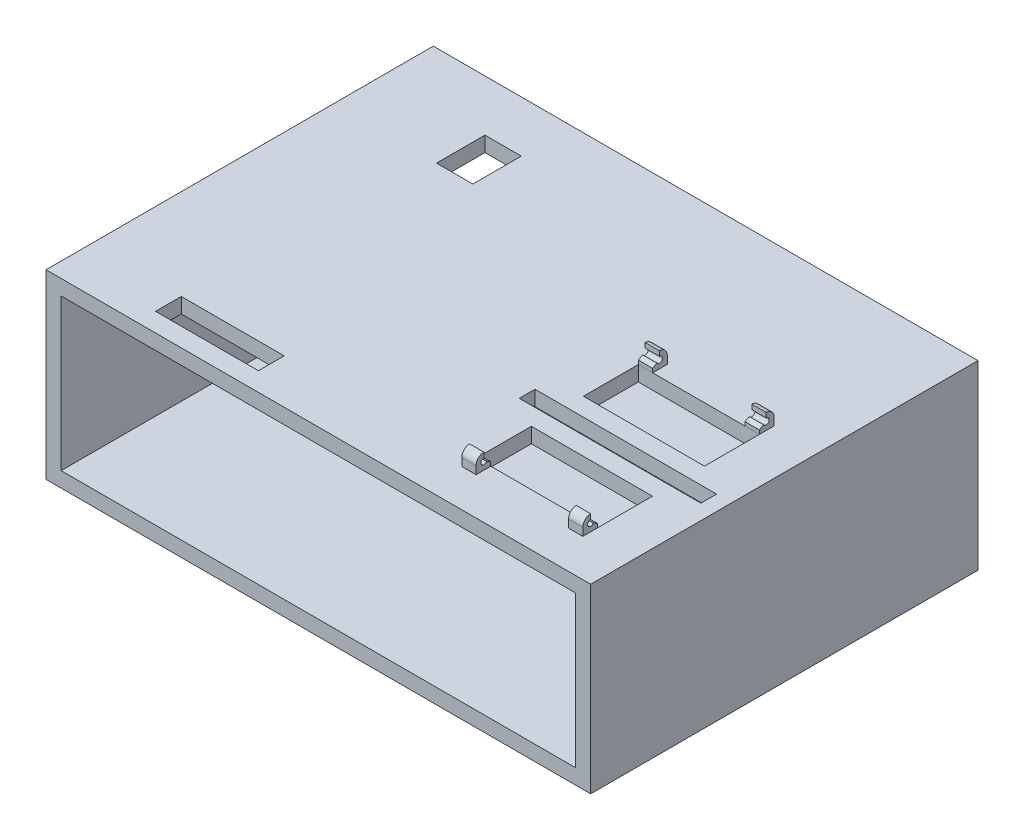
ISO-10303-21;
HEADER;
FILE_DESCRIPTION(('STEP AP214'),'2;1');
FILE_NAME('part.step','',(''),(''),'','','');
FILE_SCHEMA(('AUTOMOTIVE_DESIGN { 1 0 10303 214 1 1 1 1 }'));
ENDSEC;
DATA;
#1=APPLICATION_CONTEXT('core data for automotive mechanical design processes');
#2=APPLICATION_PROTOCOL_DEFINITION('international standard','automotive_design',2000,#1);
#3=PRODUCT_CONTEXT('',#1,'mechanical');
#4=PRODUCT('Part','Part','',(#3));
#5=PRODUCT_RELATED_PRODUCT_CATEGORY('part','',(#4));
#6=PRODUCT_DEFINITION_FORMATION('','',#4);
#7=PRODUCT_DEFINITION_CONTEXT('part definition',#1,'design');
#8=PRODUCT_DEFINITION('design','',#6,#7);
#9=PRODUCT_DEFINITION_SHAPE('','',#8);
#10=(LENGTH_UNIT() NAMED_UNIT(*) SI_UNIT(.MILLI.,.METRE.));
#11=(NAMED_UNIT(*) PLANE_ANGLE_UNIT() SI_UNIT($,.RADIAN.));
#12=(NAMED_UNIT(*) SI_UNIT($,.STERADIAN.) SOLID_ANGLE_UNIT());
#13=UNCERTAINTY_MEASURE_WITH_UNIT(LENGTH_MEASURE(1.E-05),#10,'distance_accuracy_value','');
#14=(GEOMETRIC_REPRESENTATION_CONTEXT(3) GLOBAL_UNCERTAINTY_ASSIGNED_CONTEXT((#13)) GLOBAL_UNIT_ASSIGNED_CONTEXT((#10,
#11,#12)) REPRESENTATION_CONTEXT('',''));
#15=CARTESIAN_POINT('',(0.,0.,0.));
#16=DIRECTION('',(0.,0.,1.));
#17=DIRECTION('',(1.,0.,0.));
#18=AXIS2_PLACEMENT_3D('',#15,#16,#17);
#19=CARTESIAN_POINT('',(50.45,0.,0.));
#20=DIRECTION('',(0.,-1.,0.));
#21=DIRECTION('',(0.,0.,1.));
#22=AXIS2_PLACEMENT_3D('',#19,#20,#21);
#23=PLANE('',#22);
#24=DIRECTION('',(0.,0.,-1.));
#25=VECTOR('',#24,1.);
#26=CARTESIAN_POINT('',(44.45,0.,0.));
#27=LINE('',#26,#25);
#28=CARTESIAN_POINT('',(44.45,0.,-33.9703841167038));
#29=VERTEX_POINT('',#28);
#30=CARTESIAN_POINT('',(44.45,0.,-40.132));
#31=VERTEX_POINT('',#30);
#32=EDGE_CURVE('E152',#29,#31,#27,.T.);
#33=ORIENTED_EDGE('',*,*,#32,.T.);
#34=DIRECTION('',(-1.,0.,0.));
#35=VECTOR('',#34,1.);
#36=CARTESIAN_POINT('',(50.45,0.,-40.132));
#37=LINE('',#36,#35);
#38=CARTESIAN_POINT('',(50.45,0.,-40.132));
#39=VERTEX_POINT('',#38);
#40=EDGE_CURVE('E151',#39,#31,#37,.T.);
#41=ORIENTED_EDGE('',*,*,#40,.F.);
#42=DIRECTION('',(0.,0.,-1.));
#43=VECTOR('',#42,1.);
#44=CARTESIAN_POINT('',(50.45,0.,0.));
#45=LINE('',#44,#43);
#46=CARTESIAN_POINT('',(50.45,0.,-33.9703841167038));
#47=VERTEX_POINT('',#46);
#48=EDGE_CURVE('E166',#47,#39,#45,.T.);
#49=ORIENTED_EDGE('',*,*,#48,.F.);
#50=DIRECTION('',(-1.,0.,0.));
#51=VECTOR('',#50,1.);
#52=CARTESIAN_POINT('',(50.45,0.,-33.9703841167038));
#53=LINE('',#52,#51);
#54=EDGE_CURVE('E13',#47,#29,#53,.T.);
#55=ORIENTED_EDGE('',*,*,#54,.T.);
#56=EDGE_LOOP('',(#33,#41,#49,#55));
#57=FACE_BOUND('',#56,.T.);
#58=ADVANCED_FACE('F62',(#57),#23,.T.);
#59=CARTESIAN_POINT('',(50.45,1.45594126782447E-13,-33.9703841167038));
#60=DIRECTION('',(0.,0.,-1.));
#61=DIRECTION('',(0.,-1.,0.));
#62=AXIS2_PLACEMENT_3D('',#59,#60,#61);
#63=PLANE('',#62);
#64=DIRECTION('',(0.,1.,0.));
#65=VECTOR('',#64,1.);
#66=CARTESIAN_POINT('',(44.45,1.45594126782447E-13,-33.9703841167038));
#67=LINE('',#66,#65);
#68=CARTESIAN_POINT('',(44.45,1.619,-33.9703841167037));
#69=VERTEX_POINT('',#68);
#70=EDGE_CURVE('E155',#29,#69,#67,.T.);
#71=ORIENTED_EDGE('',*,*,#70,.F.);
#72=ORIENTED_EDGE('',*,*,#54,.F.);
#73=DIRECTION('',(0.,1.,0.));
#74=VECTOR('',#73,1.);
#75=CARTESIAN_POINT('',(50.45,1.45594126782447E-13,-33.9703841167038));
#76=LINE('',#75,#74);
#77=CARTESIAN_POINT('',(50.45,1.619,-33.9703841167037));
#78=VERTEX_POINT('',#77);
#79=EDGE_CURVE('E113',#47,#78,#76,.T.);
#80=ORIENTED_EDGE('',*,*,#79,.T.);
#81=DIRECTION('',(-1.,0.,0.));
#82=VECTOR('',#81,1.);
#83=CARTESIAN_POINT('',(50.45,1.619,-33.9703841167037));
#84=LINE('',#83,#82);
#85=EDGE_CURVE('E70',#78,#69,#84,.T.);
#86=ORIENTED_EDGE('',*,*,#85,.T.);
#87=EDGE_LOOP('',(#71,#72,#80,#86));
#88=FACE_BOUND('',#87,.T.);
#89=ADVANCED_FACE('F175',(#88),#63,.F.);
#90=CARTESIAN_POINT('',(50.45,-13.4953578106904,-7.79154846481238));
#91=DIRECTION('',(0.,0.866025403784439,0.499999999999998));
#92=DIRECTION('',(0.,0.499999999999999,-0.86602540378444));
#93=AXIS2_PLACEMENT_3D('',#90,#91,#92);
#94=PLANE('',#93);
#95=DIRECTION('',(0.,-0.499999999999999,0.866025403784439));
#96=VECTOR('',#95,1.);
#97=CARTESIAN_POINT('',(44.45,-13.4953578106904,-7.79154846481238));
#98=LINE('',#97,#96);
#99=CARTESIAN_POINT('',(44.45,2.635,-35.7301477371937));
#100=VERTEX_POINT('',#99);
#101=EDGE_CURVE('E158',#100,#69,#98,.T.);
#102=ORIENTED_EDGE('',*,*,#101,.T.);
#103=ORIENTED_EDGE('',*,*,#85,.F.);
#104=DIRECTION('',(0.,-0.499999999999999,0.866025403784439));
#105=VECTOR('',#104,1.);
#106=CARTESIAN_POINT('',(50.45,-13.4953578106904,-7.79154846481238));
#107=LINE('',#106,#105);
#108=CARTESIAN_POINT('',(50.45,2.635,-35.7301477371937));
#109=VERTEX_POINT('',#108);
#110=EDGE_CURVE('E146',#109,#78,#107,.T.);
#111=ORIENTED_EDGE('',*,*,#110,.F.);
#112=DIRECTION('',(-1.,0.,0.));
#113=VECTOR('',#112,1.);
#114=CARTESIAN_POINT('',(50.45,2.635,-35.7301477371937));
#115=LINE('',#114,#113);
#116=EDGE_CURVE('E170',#109,#100,#115,.T.);
#117=ORIENTED_EDGE('',*,*,#116,.T.);
#118=EDGE_LOOP('',(#102,#103,#111,#117));
#119=FACE_BOUND('',#118,.T.);
#120=ADVANCED_FACE('F187',(#119),#94,.T.);
#121=CARTESIAN_POINT('',(50.45,3.27,-36.83));
#122=DIRECTION('',(-1.,0.,0.));
#123=DIRECTION('',(0.,0.,-1.));
#124=AXIS2_PLACEMENT_3D('',#121,#122,#123);
#125=CYLINDRICAL_SURFACE('',#124,1.27);
#126=CARTESIAN_POINT('',(44.45,3.27,-36.83));
#127=DIRECTION('',(-1.,0.,0.));
#128=DIRECTION('',(0.,0.,1.));
#129=AXIS2_PLACEMENT_3D('',#126,#127,#128);
#130=CIRCLE('',#129,1.27);
#131=CARTESIAN_POINT('',(44.45,4.54,-36.83));
#132=VERTEX_POINT('',#131);
#133=EDGE_CURVE('E160',#132,#100,#130,.T.);
#134=ORIENTED_EDGE('',*,*,#133,.T.);
#135=ORIENTED_EDGE('',*,*,#116,.F.);
#136=CARTESIAN_POINT('',(50.45,3.27,-36.83));
#137=DIRECTION('',(-1.,0.,0.));
#138=DIRECTION('',(0.,0.,1.));
#139=AXIS2_PLACEMENT_3D('',#136,#137,#138);
#140=CIRCLE('',#139,1.27);
#141=CARTESIAN_POINT('',(50.45,4.54,-36.83));
#142=VERTEX_POINT('',#141);
#143=EDGE_CURVE('E144',#142,#109,#140,.T.);
#144=ORIENTED_EDGE('',*,*,#143,.F.);
#145=DIRECTION('',(-1.,0.,0.));
#146=VECTOR('',#145,1.);
#147=CARTESIAN_POINT('',(50.45,4.54,-36.83));
#148=LINE('',#147,#146);
#149=EDGE_CURVE('E138',#142,#132,#148,.T.);
#150=ORIENTED_EDGE('',*,*,#149,.T.);
#151=EDGE_LOOP('',(#134,#135,#144,#150));
#152=FACE_BOUND('',#151,.T.);
#153=ADVANCED_FACE('F189',(#152),#125,.F.);
#154=CARTESIAN_POINT('',(50.45,0.,-36.83));
#155=DIRECTION('',(0.,0.,-1.));
#156=DIRECTION('',(1.,0.,0.));
#157=AXIS2_PLACEMENT_3D('',#154,#155,#156);
#158=PLANE('',#157);
#159=DIRECTION('',(0.,1.,0.));
#160=VECTOR('',#159,1.);
#161=CARTESIAN_POINT('',(44.45,0.,-36.83));
#162=LINE('',#161,#160);
#163=CARTESIAN_POINT('',(44.45,6.572,-36.83));
#164=VERTEX_POINT('',#163);
#165=EDGE_CURVE('E162',#132,#164,#162,.T.);
#166=ORIENTED_EDGE('',*,*,#165,.F.);
#167=ORIENTED_EDGE('',*,*,#149,.F.);
#168=DIRECTION('',(0.,1.,0.));
#169=VECTOR('',#168,1.);
#170=CARTESIAN_POINT('',(50.45,0.,-36.83));
#171=LINE('',#170,#169);
#172=CARTESIAN_POINT('',(50.45,6.572,-36.83));
#173=VERTEX_POINT('',#172);
#174=EDGE_CURVE('E128',#142,#173,#171,.T.);
#175=ORIENTED_EDGE('',*,*,#174,.T.);
#176=DIRECTION('',(-1.,0.,0.));
#177=VECTOR('',#176,1.);
#178=CARTESIAN_POINT('',(50.45,6.572,-36.83));
#179=LINE('',#178,#177);
#180=EDGE_CURVE('E133',#173,#164,#179,.T.);
#181=ORIENTED_EDGE('',*,*,#180,.T.);
#182=EDGE_LOOP('',(#166,#167,#175,#181));
#183=FACE_BOUND('',#182,.T.);
#184=ADVANCED_FACE('F141',(#183),#158,.F.);
#185=CARTESIAN_POINT('',(50.45,3.27,-36.83));
#186=DIRECTION('',(-1.,0.,0.));
#187=DIRECTION('',(0.,0.,-1.));
#188=AXIS2_PLACEMENT_3D('',#185,#186,#187);
#189=CYLINDRICAL_SURFACE('',#188,3.302);
#190=CARTESIAN_POINT('',(44.45,3.27,-36.83));
#191=DIRECTION('',(-1.,0.,0.));
#192=DIRECTION('',(0.,0.,1.));
#193=AXIS2_PLACEMENT_3D('',#190,#191,#192);
#194=CIRCLE('',#193,3.302);
#195=CARTESIAN_POINT('',(44.45,3.27,-40.132));
#196=VERTEX_POINT('',#195);
#197=EDGE_CURVE('E135',#164,#196,#194,.T.);
#198=ORIENTED_EDGE('',*,*,#197,.F.);
#199=ORIENTED_EDGE('',*,*,#180,.F.);
#200=CARTESIAN_POINT('',(50.45,3.27,-36.83));
#201=DIRECTION('',(-1.,0.,0.));
#202=DIRECTION('',(0.,0.,1.));
#203=AXIS2_PLACEMENT_3D('',#200,#201,#202);
#204=CIRCLE('',#203,3.302);
#205=CARTESIAN_POINT('',(50.45,3.27,-40.132));
#206=VERTEX_POINT('',#205);
#207=EDGE_CURVE('E124',#173,#206,#204,.T.);
#208=ORIENTED_EDGE('',*,*,#207,.T.);
#209=DIRECTION('',(-1.,0.,0.));
#210=VECTOR('',#209,1.);
#211=CARTESIAN_POINT('',(50.45,3.27,-40.132));
#212=LINE('',#211,#210);
#213=EDGE_CURVE('E139',#206,#196,#212,.T.);
#214=ORIENTED_EDGE('',*,*,#213,.T.);
#215=EDGE_LOOP('',(#198,#199,#208,#214));
#216=FACE_BOUND('',#215,.T.);
#217=ADVANCED_FACE('F134',(#216),#189,.T.);
#218=CARTESIAN_POINT('',(50.45,0.,-40.132));
#219=DIRECTION('',(0.,0.,1.));
#220=DIRECTION('',(-1.,0.,0.));
#221=AXIS2_PLACEMENT_3D('',#218,#219,#220);
#222=PLANE('',#221);
#223=DIRECTION('',(0.,-1.,0.));
#224=VECTOR('',#223,1.);
#225=CARTESIAN_POINT('',(44.45,0.,-40.132));
#226=LINE('',#225,#224);
#227=EDGE_CURVE('E101',#196,#31,#226,.T.);
#228=ORIENTED_EDGE('',*,*,#227,.F.);
#229=ORIENTED_EDGE('',*,*,#213,.F.);
#230=DIRECTION('',(0.,-1.,0.));
#231=VECTOR('',#230,1.);
#232=CARTESIAN_POINT('',(50.45,0.,-40.132));
#233=LINE('',#232,#231);
#234=EDGE_CURVE('E78',#206,#39,#233,.T.);
#235=ORIENTED_EDGE('',*,*,#234,.T.);
#236=ORIENTED_EDGE('',*,*,#40,.T.);
#237=EDGE_LOOP('',(#228,#229,#235,#236));
#238=FACE_BOUND('',#237,.T.);
#239=ADVANCED_FACE('F229',(#238),#222,.F.);
#240=CARTESIAN_POINT('',(50.45,0.,0.));
#241=DIRECTION('',(1.,0.,0.));
#242=DIRECTION('',(0.,0.,1.));
#243=AXIS2_PLACEMENT_3D('',#240,#241,#242);
#244=PLANE('',#243);
#245=ORIENTED_EDGE('',*,*,#48,.T.);
#246=ORIENTED_EDGE('',*,*,#234,.F.);
#247=ORIENTED_EDGE('',*,*,#207,.F.);
#248=ORIENTED_EDGE('',*,*,#174,.F.);
#249=ORIENTED_EDGE('',*,*,#143,.T.);
#250=ORIENTED_EDGE('',*,*,#110,.T.);
#251=ORIENTED_EDGE('',*,*,#79,.F.);
#252=EDGE_LOOP('',(#245,#246,#247,#248,#249,#250,#251));
#253=FACE_BOUND('',#252,.T.);
#254=ADVANCED_FACE('F126',(#253),#244,.T.);
#255=CARTESIAN_POINT('',(44.45,0.,0.));
#256=DIRECTION('',(1.,0.,0.));
#257=DIRECTION('',(0.,0.,1.));
#258=AXIS2_PLACEMENT_3D('',#255,#256,#257);
#259=PLANE('',#258);
#260=ORIENTED_EDGE('',*,*,#32,.F.);
#261=ORIENTED_EDGE('',*,*,#70,.T.);
#262=ORIENTED_EDGE('',*,*,#101,.F.);
#263=ORIENTED_EDGE('',*,*,#133,.F.);
#264=ORIENTED_EDGE('',*,*,#165,.T.);
#265=ORIENTED_EDGE('',*,*,#197,.T.);
#266=ORIENTED_EDGE('',*,*,#227,.T.);
#267=EDGE_LOOP('',(#260,#261,#262,#263,#264,#265,#266));
#268=FACE_BOUND('',#267,.T.);
#269=ADVANCED_FACE('F179',(#268),#259,.F.);
#270=CLOSED_SHELL('',(#58,#89,#120,#153,#184,#217,#239,#254,#269));
#271=MANIFOLD_SOLID_BREP('B2',#270);
#272=CARTESIAN_POINT('',(89.25,0.,0.));
#273=DIRECTION('',(0.,1.,0.));
#274=DIRECTION('',(0.,0.,-1.));
#275=AXIS2_PLACEMENT_3D('',#272,#273,#274);
#276=PLANE('',#275);
#277=DIRECTION('',(0.,0.,-1.));
#278=VECTOR('',#277,1.);
#279=CARTESIAN_POINT('',(95.25,0.,0.));
#280=LINE('',#279,#278);
#281=CARTESIAN_POINT('',(95.25,0.,-33.9703841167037));
#282=VERTEX_POINT('',#281);
#283=CARTESIAN_POINT('',(95.25,0.,-40.132));
#284=VERTEX_POINT('',#283);
#285=EDGE_CURVE('E390',#282,#284,#280,.T.);
#286=ORIENTED_EDGE('',*,*,#285,.F.);
#287=DIRECTION('',(1.,0.,0.));
#288=VECTOR('',#287,1.);
#289=CARTESIAN_POINT('',(89.25,0.,-33.9703841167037));
#290=LINE('',#289,#288);
#291=CARTESIAN_POINT('',(89.25,0.,-33.9703841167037));
#292=VERTEX_POINT('',#291);
#293=EDGE_CURVE('E303',#292,#282,#290,.T.);
#294=ORIENTED_EDGE('',*,*,#293,.F.);
#295=DIRECTION('',(0.,0.,-1.));
#296=VECTOR('',#295,1.);
#297=CARTESIAN_POINT('',(89.25,0.,0.));
#298=LINE('',#297,#296);
#299=CARTESIAN_POINT('',(89.25,0.,-40.132));
#300=VERTEX_POINT('',#299);
#301=EDGE_CURVE('E403',#292,#300,#298,.T.);
#302=ORIENTED_EDGE('',*,*,#301,.T.);
#303=DIRECTION('',(1.,0.,0.));
#304=VECTOR('',#303,1.);
#305=CARTESIAN_POINT('',(89.25,0.,-40.132));
#306=LINE('',#305,#304);
#307=EDGE_CURVE('E60',#300,#284,#306,.T.);
#308=ORIENTED_EDGE('',*,*,#307,.T.);
#309=EDGE_LOOP('',(#286,#294,#302,#308));
#310=FACE_BOUND('',#309,.T.);
#311=ADVANCED_FACE('F300',(#310),#276,.F.);
#312=CARTESIAN_POINT('',(89.25,0.,-40.132));
#313=DIRECTION('',(0.,0.,-1.));
#314=DIRECTION('',(1.,0.,0.));
#315=AXIS2_PLACEMENT_3D('',#312,#313,#314);
#316=PLANE('',#315);
#317=DIRECTION('',(0.,-1.,0.));
#318=VECTOR('',#317,1.);
#319=CARTESIAN_POINT('',(95.25,0.,-40.132));
#320=LINE('',#319,#318);
#321=CARTESIAN_POINT('',(95.25,3.27,-40.132));
#322=VERTEX_POINT('',#321);
#323=EDGE_CURVE('E350',#322,#284,#320,.T.);
#324=ORIENTED_EDGE('',*,*,#323,.T.);
#325=ORIENTED_EDGE('',*,*,#307,.F.);
#326=DIRECTION('',(0.,-1.,0.));
#327=VECTOR('',#326,1.);
#328=CARTESIAN_POINT('',(89.25,0.,-40.132));
#329=LINE('',#328,#327);
#330=CARTESIAN_POINT('',(89.25,3.27,-40.132));
#331=VERTEX_POINT('',#330);
#332=EDGE_CURVE('E318',#331,#300,#329,.T.);
#333=ORIENTED_EDGE('',*,*,#332,.F.);
#334=DIRECTION('',(1.,0.,0.));
#335=VECTOR('',#334,1.);
#336=CARTESIAN_POINT('',(89.25,3.27,-40.132));
#337=LINE('',#336,#335);
#338=EDGE_CURVE('E309',#331,#322,#337,.T.);
#339=ORIENTED_EDGE('',*,*,#338,.T.);
#340=EDGE_LOOP('',(#324,#325,#333,#339));
#341=FACE_BOUND('',#340,.T.);
#342=ADVANCED_FACE('F437',(#341),#316,.T.);
#343=CARTESIAN_POINT('',(89.25,3.27,-36.83));
#344=DIRECTION('',(1.,0.,0.));
#345=DIRECTION('',(0.,0.,1.));
#346=AXIS2_PLACEMENT_3D('',#343,#344,#345);
#347=CYLINDRICAL_SURFACE('',#346,3.302);
#348=CARTESIAN_POINT('',(95.25,3.27,-36.83));
#349=DIRECTION('',(-1.,0.,0.));
#350=DIRECTION('',(0.,0.,1.));
#351=AXIS2_PLACEMENT_3D('',#348,#349,#350);
#352=CIRCLE('',#351,3.302);
#353=CARTESIAN_POINT('',(95.25,6.572,-36.83));
#354=VERTEX_POINT('',#353);
#355=EDGE_CURVE('E344',#354,#322,#352,.T.);
#356=ORIENTED_EDGE('',*,*,#355,.T.);
#357=ORIENTED_EDGE('',*,*,#338,.F.);
#358=CARTESIAN_POINT('',(89.25,3.27,-36.83));
#359=DIRECTION('',(-1.,0.,0.));
#360=DIRECTION('',(0.,0.,1.));
#361=AXIS2_PLACEMENT_3D('',#358,#359,#360);
#362=CIRCLE('',#361,3.302);
#363=CARTESIAN_POINT('',(89.25,6.572,-36.83));
#364=VERTEX_POINT('',#363);
#365=EDGE_CURVE('E372',#364,#331,#362,.T.);
#366=ORIENTED_EDGE('',*,*,#365,.F.);
#367=DIRECTION('',(1.,0.,0.));
#368=VECTOR('',#367,1.);
#369=CARTESIAN_POINT('',(89.25,6.572,-36.83));
#370=LINE('',#369,#368);
#371=EDGE_CURVE('E379',#364,#354,#370,.T.);
#372=ORIENTED_EDGE('',*,*,#371,.T.);
#373=EDGE_LOOP('',(#356,#357,#366,#372));
#374=FACE_BOUND('',#373,.T.);
#375=ADVANCED_FACE('F385',(#374),#347,.T.);
#376=CARTESIAN_POINT('',(89.25,0.,-36.83));
#377=DIRECTION('',(0.,0.,1.));
#378=DIRECTION('',(-1.,0.,0.));
#379=AXIS2_PLACEMENT_3D('',#376,#377,#378);
#380=PLANE('',#379);
#381=DIRECTION('',(0.,1.,0.));
#382=VECTOR('',#381,1.);
#383=CARTESIAN_POINT('',(95.25,0.,-36.83));
#384=LINE('',#383,#382);
#385=CARTESIAN_POINT('',(95.25,4.54,-36.83));
#386=VERTEX_POINT('',#385);
#387=EDGE_CURVE('E382',#386,#354,#384,.T.);
#388=ORIENTED_EDGE('',*,*,#387,.T.);
#389=ORIENTED_EDGE('',*,*,#371,.F.);
#390=DIRECTION('',(0.,1.,0.));
#391=VECTOR('',#390,1.);
#392=CARTESIAN_POINT('',(89.25,0.,-36.83));
#393=LINE('',#392,#391);
#394=CARTESIAN_POINT('',(89.25,4.54,-36.83));
#395=VERTEX_POINT('',#394);
#396=EDGE_CURVE('E368',#395,#364,#393,.T.);
#397=ORIENTED_EDGE('',*,*,#396,.F.);
#398=DIRECTION('',(1.,0.,0.));
#399=VECTOR('',#398,1.);
#400=CARTESIAN_POINT('',(89.25,4.54,-36.83));
#401=LINE('',#400,#399);
#402=EDGE_CURVE('E383',#395,#386,#401,.T.);
#403=ORIENTED_EDGE('',*,*,#402,.T.);
#404=EDGE_LOOP('',(#388,#389,#397,#403));
#405=FACE_BOUND('',#404,.T.);
#406=ADVANCED_FACE('F380',(#405),#380,.T.);
#407=CARTESIAN_POINT('',(89.25,3.27,-36.83));
#408=DIRECTION('',(1.,0.,0.));
#409=DIRECTION('',(0.,0.,1.));
#410=AXIS2_PLACEMENT_3D('',#407,#408,#409);
#411=CYLINDRICAL_SURFACE('',#410,1.27);
#412=CARTESIAN_POINT('',(95.25,3.27,-36.83));
#413=DIRECTION('',(-1.,0.,0.));
#414=DIRECTION('',(0.,0.,1.));
#415=AXIS2_PLACEMENT_3D('',#412,#413,#414);
#416=CIRCLE('',#415,1.27);
#417=CARTESIAN_POINT('',(95.25,2.635,-35.7301477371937));
#418=VERTEX_POINT('',#417);
#419=EDGE_CURVE('E398',#386,#418,#416,.T.);
#420=ORIENTED_EDGE('',*,*,#419,.F.);
#421=ORIENTED_EDGE('',*,*,#402,.F.);
#422=CARTESIAN_POINT('',(89.25,3.27,-36.83));
#423=DIRECTION('',(-1.,0.,0.));
#424=DIRECTION('',(0.,0.,1.));
#425=AXIS2_PLACEMENT_3D('',#422,#423,#424);
#426=CIRCLE('',#425,1.27);
#427=CARTESIAN_POINT('',(89.25,2.635,-35.7301477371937));
#428=VERTEX_POINT('',#427);
#429=EDGE_CURVE('E374',#395,#428,#426,.T.);
#430=ORIENTED_EDGE('',*,*,#429,.T.);
#431=DIRECTION('',(1.,0.,0.));
#432=VECTOR('',#431,1.);
#433=CARTESIAN_POINT('',(89.25,2.635,-35.7301477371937));
#434=LINE('',#433,#432);
#435=EDGE_CURVE('E407',#428,#418,#434,.T.);
#436=ORIENTED_EDGE('',*,*,#435,.T.);
#437=EDGE_LOOP('',(#420,#421,#430,#436));
#438=FACE_BOUND('',#437,.T.);
#439=ADVANCED_FACE('F423',(#438),#411,.F.);
#440=CARTESIAN_POINT('',(89.25,-13.4953578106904,-7.79154846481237));
#441=DIRECTION('',(0.,-0.866025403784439,-0.499999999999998));
#442=DIRECTION('',(0.,-0.499999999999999,0.86602540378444));
#443=AXIS2_PLACEMENT_3D('',#440,#441,#442);
#444=PLANE('',#443);
#445=DIRECTION('',(0.,-0.499999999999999,0.866025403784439));
#446=VECTOR('',#445,1.);
#447=CARTESIAN_POINT('',(95.25,-13.4953578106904,-7.79154846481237));
#448=LINE('',#447,#446);
#449=CARTESIAN_POINT('',(95.25,1.619,-33.9703841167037));
#450=VERTEX_POINT('',#449);
#451=EDGE_CURVE('E395',#418,#450,#448,.T.);
#452=ORIENTED_EDGE('',*,*,#451,.F.);
#453=ORIENTED_EDGE('',*,*,#435,.F.);
#454=DIRECTION('',(0.,-0.499999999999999,0.866025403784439));
#455=VECTOR('',#454,1.);
#456=CARTESIAN_POINT('',(89.25,-13.4953578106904,-7.79154846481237));
#457=LINE('',#456,#455);
#458=CARTESIAN_POINT('',(89.25,1.619,-33.9703841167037));
#459=VERTEX_POINT('',#458);
#460=EDGE_CURVE('E424',#428,#459,#457,.T.);
#461=ORIENTED_EDGE('',*,*,#460,.T.);
#462=DIRECTION('',(1.,0.,0.));
#463=VECTOR('',#462,1.);
#464=CARTESIAN_POINT('',(89.25,1.619,-33.9703841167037));
#465=LINE('',#464,#463);
#466=EDGE_CURVE('E409',#459,#450,#465,.T.);
#467=ORIENTED_EDGE('',*,*,#466,.T.);
#468=EDGE_LOOP('',(#452,#453,#461,#467));
#469=FACE_BOUND('',#468,.T.);
#470=ADVANCED_FACE('F421',(#469),#444,.F.);
#471=CARTESIAN_POINT('',(89.25,1.45594126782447E-13,-33.9703841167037));
#472=DIRECTION('',(0.,0.,1.));
#473=DIRECTION('',(0.,1.,0.));
#474=AXIS2_PLACEMENT_3D('',#471,#472,#473);
#475=PLANE('',#474);
#476=DIRECTION('',(0.,1.,0.));
#477=VECTOR('',#476,1.);
#478=CARTESIAN_POINT('',(95.25,1.45594126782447E-13,-33.9703841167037));
#479=LINE('',#478,#477);
#480=EDGE_CURVE('E393',#282,#450,#479,.T.);
#481=ORIENTED_EDGE('',*,*,#480,.T.);
#482=ORIENTED_EDGE('',*,*,#466,.F.);
#483=DIRECTION('',(0.,1.,0.));
#484=VECTOR('',#483,1.);
#485=CARTESIAN_POINT('',(89.25,1.45594126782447E-13,-33.9703841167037));
#486=LINE('',#485,#484);
#487=EDGE_CURVE('E358',#292,#459,#486,.T.);
#488=ORIENTED_EDGE('',*,*,#487,.F.);
#489=ORIENTED_EDGE('',*,*,#293,.T.);
#490=EDGE_LOOP('',(#481,#482,#488,#489));
#491=FACE_BOUND('',#490,.T.);
#492=ADVANCED_FACE('F415',(#491),#475,.T.);
#493=CARTESIAN_POINT('',(89.25,0.,0.));
#494=DIRECTION('',(1.,0.,0.));
#495=DIRECTION('',(0.,0.,1.));
#496=AXIS2_PLACEMENT_3D('',#493,#494,#495);
#497=PLANE('',#496);
#498=ORIENTED_EDGE('',*,*,#301,.F.);
#499=ORIENTED_EDGE('',*,*,#487,.T.);
#500=ORIENTED_EDGE('',*,*,#460,.F.);
#501=ORIENTED_EDGE('',*,*,#429,.F.);
#502=ORIENTED_EDGE('',*,*,#396,.T.);
#503=ORIENTED_EDGE('',*,*,#365,.T.);
#504=ORIENTED_EDGE('',*,*,#332,.T.);
#505=EDGE_LOOP('',(#498,#499,#500,#501,#502,#503,#504));
#506=FACE_BOUND('',#505,.T.);
#507=ADVANCED_FACE('F370',(#506),#497,.F.);
#508=CARTESIAN_POINT('',(95.25,0.,0.));
#509=DIRECTION('',(1.,0.,0.));
#510=DIRECTION('',(0.,0.,1.));
#511=AXIS2_PLACEMENT_3D('',#508,#509,#510);
#512=PLANE('',#511);
#513=ORIENTED_EDGE('',*,*,#285,.T.);
#514=ORIENTED_EDGE('',*,*,#323,.F.);
#515=ORIENTED_EDGE('',*,*,#355,.F.);
#516=ORIENTED_EDGE('',*,*,#387,.F.);
#517=ORIENTED_EDGE('',*,*,#419,.T.);
#518=ORIENTED_EDGE('',*,*,#451,.T.);
#519=ORIENTED_EDGE('',*,*,#480,.F.);
#520=EDGE_LOOP('',(#513,#514,#515,#516,#517,#518,#519));
#521=FACE_BOUND('',#520,.T.);
#522=ADVANCED_FACE('F419',(#521),#512,.T.);
#523=CLOSED_SHELL('',(#311,#342,#375,#406,#439,#470,#492,#507,#522));
#524=MANIFOLD_SOLID_BREP('B7',#523);
#525=CARTESIAN_POINT('',(50.45,0.,0.));
#526=DIRECTION('',(0.,-1.,0.));
#527=DIRECTION('',(0.,0.,-1.));
#528=AXIS2_PLACEMENT_3D('',#525,#526,#527);
#529=PLANE('',#528);
#530=DIRECTION('',(0.,0.,1.));
#531=VECTOR('',#530,1.);
#532=CARTESIAN_POINT('',(44.45,0.,0.));
#533=LINE('',#532,#531);
#534=CARTESIAN_POINT('',(44.45,0.,33.9703841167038));
#535=VERTEX_POINT('',#534);
#536=CARTESIAN_POINT('',(44.45,0.,40.132));
#537=VERTEX_POINT('',#536);
#538=EDGE_CURVE('E625',#535,#537,#533,.T.);
#539=ORIENTED_EDGE('',*,*,#538,.F.);
#540=DIRECTION('',(-1.,0.,0.));
#541=VECTOR('',#540,1.);
#542=CARTESIAN_POINT('',(50.45,0.,33.9703841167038));
#543=LINE('',#542,#541);
#544=CARTESIAN_POINT('',(50.45,0.,33.9703841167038));
#545=VERTEX_POINT('',#544);
#546=EDGE_CURVE('E298',#545,#535,#543,.T.);
#547=ORIENTED_EDGE('',*,*,#546,.F.);
#548=DIRECTION('',(0.,0.,1.));
#549=VECTOR('',#548,1.);
#550=CARTESIAN_POINT('',(50.45,0.,0.));
#551=LINE('',#550,#549);
#552=CARTESIAN_POINT('',(50.45,0.,40.132));
#553=VERTEX_POINT('',#552);
#554=EDGE_CURVE('E641',#545,#553,#551,.T.);
#555=ORIENTED_EDGE('',*,*,#554,.T.);
#556=DIRECTION('',(-1.,0.,0.));
#557=VECTOR('',#556,1.);
#558=CARTESIAN_POINT('',(50.45,0.,40.132));
#559=LINE('',#558,#557);
#560=EDGE_CURVE('E586',#553,#537,#559,.T.);
#561=ORIENTED_EDGE('',*,*,#560,.T.);
#562=EDGE_LOOP('',(#539,#547,#555,#561));
#563=FACE_BOUND('',#562,.T.);
#564=ADVANCED_FACE('F538',(#563),#529,.T.);
#565=CARTESIAN_POINT('',(50.45,1.45594126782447E-13,33.9703841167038));
#566=DIRECTION('',(0.,0.,1.));
#567=DIRECTION('',(0.,-1.,0.));
#568=AXIS2_PLACEMENT_3D('',#565,#566,#567);
#569=PLANE('',#568);
#570=DIRECTION('',(0.,1.,0.));
#571=VECTOR('',#570,1.);
#572=CARTESIAN_POINT('',(44.45,1.45594126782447E-13,33.9703841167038));
#573=LINE('',#572,#571);
#574=CARTESIAN_POINT('',(44.45,1.619,33.9703841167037));
#575=VERTEX_POINT('',#574);
#576=EDGE_CURVE('E628',#535,#575,#573,.T.);
#577=ORIENTED_EDGE('',*,*,#576,.T.);
#578=DIRECTION('',(-1.,0.,0.));
#579=VECTOR('',#578,1.);
#580=CARTESIAN_POINT('',(50.45,1.619,33.9703841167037));
#581=LINE('',#580,#579);
#582=CARTESIAN_POINT('',(50.45,1.619,33.9703841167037));
#583=VERTEX_POINT('',#582);
#584=EDGE_CURVE('E546',#583,#575,#581,.T.);
#585=ORIENTED_EDGE('',*,*,#584,.F.);
#586=DIRECTION('',(0.,1.,0.));
#587=VECTOR('',#586,1.);
#588=CARTESIAN_POINT('',(50.45,1.45594126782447E-13,33.9703841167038));
#589=LINE('',#588,#587);
#590=EDGE_CURVE('E660',#545,#583,#589,.T.);
#591=ORIENTED_EDGE('',*,*,#590,.F.);
#592=ORIENTED_EDGE('',*,*,#546,.T.);
#593=EDGE_LOOP('',(#577,#585,#591,#592));
#594=FACE_BOUND('',#593,.T.);
#595=ADVANCED_FACE('F654',(#594),#569,.F.);
#596=CARTESIAN_POINT('',(50.45,-13.4953578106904,7.79154846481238));
#597=DIRECTION('',(0.,0.866025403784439,-0.499999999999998));
#598=DIRECTION('',(0.,0.499999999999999,0.86602540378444));
#599=AXIS2_PLACEMENT_3D('',#596,#597,#598);
#600=PLANE('',#599);
#601=DIRECTION('',(0.,-0.499999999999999,-0.866025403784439));
#602=VECTOR('',#601,1.);
#603=CARTESIAN_POINT('',(44.45,-13.4953578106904,7.79154846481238));
#604=LINE('',#603,#602);
#605=CARTESIAN_POINT('',(44.45,2.635,35.7301477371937));
#606=VERTEX_POINT('',#605);
#607=EDGE_CURVE('E631',#606,#575,#604,.T.);
#608=ORIENTED_EDGE('',*,*,#607,.F.);
#609=DIRECTION('',(-1.,0.,0.));
#610=VECTOR('',#609,1.);
#611=CARTESIAN_POINT('',(50.45,2.635,35.7301477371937));
#612=LINE('',#611,#610);
#613=CARTESIAN_POINT('',(50.45,2.635,35.7301477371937));
#614=VERTEX_POINT('',#613);
#615=EDGE_CURVE('E645',#614,#606,#612,.T.);
#616=ORIENTED_EDGE('',*,*,#615,.F.);
#617=DIRECTION('',(0.,-0.499999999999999,-0.866025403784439));
#618=VECTOR('',#617,1.);
#619=CARTESIAN_POINT('',(50.45,-13.4953578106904,7.79154846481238));
#620=LINE('',#619,#618);
#621=EDGE_CURVE('E651',#614,#583,#620,.T.);
#622=ORIENTED_EDGE('',*,*,#621,.T.);
#623=ORIENTED_EDGE('',*,*,#584,.T.);
#624=EDGE_LOOP('',(#608,#616,#622,#623));
#625=FACE_BOUND('',#624,.T.);
#626=ADVANCED_FACE('F650',(#625),#600,.T.);
#627=CARTESIAN_POINT('',(50.45,3.27,36.83));
#628=DIRECTION('',(-1.,0.,0.));
#629=DIRECTION('',(0.,0.,1.));
#630=AXIS2_PLACEMENT_3D('',#627,#628,#629);
#631=CYLINDRICAL_SURFACE('',#630,1.27);
#632=CARTESIAN_POINT('',(44.45,3.27,36.83));
#633=DIRECTION('',(1.,0.,0.));
#634=DIRECTION('',(0.,0.,-1.));
#635=AXIS2_PLACEMENT_3D('',#632,#633,#634);
#636=CIRCLE('',#635,1.27);
#637=CARTESIAN_POINT('',(44.45,4.54,36.83));
#638=VERTEX_POINT('',#637);
#639=EDGE_CURVE('E634',#638,#606,#636,.T.);
#640=ORIENTED_EDGE('',*,*,#639,.F.);
#641=DIRECTION('',(-1.,0.,0.));
#642=VECTOR('',#641,1.);
#643=CARTESIAN_POINT('',(50.45,4.54,36.83));
#644=LINE('',#643,#642);
#645=CARTESIAN_POINT('',(50.45,4.54,36.83));
#646=VERTEX_POINT('',#645);
#647=EDGE_CURVE('E617',#646,#638,#644,.T.);
#648=ORIENTED_EDGE('',*,*,#647,.F.);
#649=CARTESIAN_POINT('',(50.45,3.27,36.83));
#650=DIRECTION('',(1.,0.,0.));
#651=DIRECTION('',(0.,0.,-1.));
#652=AXIS2_PLACEMENT_3D('',#649,#650,#651);
#653=CIRCLE('',#652,1.27);
#654=EDGE_CURVE('E610',#646,#614,#653,.T.);
#655=ORIENTED_EDGE('',*,*,#654,.T.);
#656=ORIENTED_EDGE('',*,*,#615,.T.);
#657=EDGE_LOOP('',(#640,#648,#655,#656));
#658=FACE_BOUND('',#657,.T.);
#659=ADVANCED_FACE('F659',(#658),#631,.F.);
#660=CARTESIAN_POINT('',(50.45,0.,36.83));
#661=DIRECTION('',(0.,0.,1.));
#662=DIRECTION('',(1.,0.,0.));
#663=AXIS2_PLACEMENT_3D('',#660,#661,#662);
#664=PLANE('',#663);
#665=DIRECTION('',(0.,1.,0.));
#666=VECTOR('',#665,1.);
#667=CARTESIAN_POINT('',(44.45,0.,36.83));
#668=LINE('',#667,#666);
#669=CARTESIAN_POINT('',(44.45,6.572,36.83));
#670=VERTEX_POINT('',#669);
#671=EDGE_CURVE('E616',#638,#670,#668,.T.);
#672=ORIENTED_EDGE('',*,*,#671,.T.);
#673=DIRECTION('',(-1.,0.,0.));
#674=VECTOR('',#673,1.);
#675=CARTESIAN_POINT('',(50.45,6.572,36.83));
#676=LINE('',#675,#674);
#677=CARTESIAN_POINT('',(50.45,6.572,36.83));
#678=VERTEX_POINT('',#677);
#679=EDGE_CURVE('E613',#678,#670,#676,.T.);
#680=ORIENTED_EDGE('',*,*,#679,.F.);
#681=DIRECTION('',(0.,1.,0.));
#682=VECTOR('',#681,1.);
#683=CARTESIAN_POINT('',(50.45,0.,36.83));
#684=LINE('',#683,#682);
#685=EDGE_CURVE('E603',#646,#678,#684,.T.);
#686=ORIENTED_EDGE('',*,*,#685,.F.);
#687=ORIENTED_EDGE('',*,*,#647,.T.);
#688=EDGE_LOOP('',(#672,#680,#686,#687));
#689=FACE_BOUND('',#688,.T.);
#690=ADVANCED_FACE('F614',(#689),#664,.F.);
#691=CARTESIAN_POINT('',(50.45,3.27,36.83));
#692=DIRECTION('',(-1.,0.,0.));
#693=DIRECTION('',(0.,0.,1.));
#694=AXIS2_PLACEMENT_3D('',#691,#692,#693);
#695=CYLINDRICAL_SURFACE('',#694,3.302);
#696=CARTESIAN_POINT('',(44.45,3.27,36.83));
#697=DIRECTION('',(1.,0.,0.));
#698=DIRECTION('',(0.,0.,-1.));
#699=AXIS2_PLACEMENT_3D('',#696,#697,#698);
#700=CIRCLE('',#699,3.302);
#701=CARTESIAN_POINT('',(44.45,3.27,40.132));
#702=VERTEX_POINT('',#701);
#703=EDGE_CURVE('E579',#670,#702,#700,.T.);
#704=ORIENTED_EDGE('',*,*,#703,.T.);
#705=DIRECTION('',(-1.,0.,0.));
#706=VECTOR('',#705,1.);
#707=CARTESIAN_POINT('',(50.45,3.27,40.132));
#708=LINE('',#707,#706);
#709=CARTESIAN_POINT('',(50.45,3.27,40.132));
#710=VERTEX_POINT('',#709);
#711=EDGE_CURVE('E618',#710,#702,#708,.T.);
#712=ORIENTED_EDGE('',*,*,#711,.F.);
#713=CARTESIAN_POINT('',(50.45,3.27,36.83));
#714=DIRECTION('',(1.,0.,0.));
#715=DIRECTION('',(0.,0.,-1.));
#716=AXIS2_PLACEMENT_3D('',#713,#714,#715);
#717=CIRCLE('',#716,3.302);
#718=EDGE_CURVE('E607',#678,#710,#717,.T.);
#719=ORIENTED_EDGE('',*,*,#718,.F.);
#720=ORIENTED_EDGE('',*,*,#679,.T.);
#721=EDGE_LOOP('',(#704,#712,#719,#720));
#722=FACE_BOUND('',#721,.T.);
#723=ADVANCED_FACE('F620',(#722),#695,.T.);
#724=CARTESIAN_POINT('',(50.45,0.,40.132));
#725=DIRECTION('',(0.,0.,-1.));
#726=DIRECTION('',(-1.,0.,0.));
#727=AXIS2_PLACEMENT_3D('',#724,#725,#726);
#728=PLANE('',#727);
#729=DIRECTION('',(0.,-1.,0.));
#730=VECTOR('',#729,1.);
#731=CARTESIAN_POINT('',(44.45,0.,40.132));
#732=LINE('',#731,#730);
#733=EDGE_CURVE('E639',#702,#537,#732,.T.);
#734=ORIENTED_EDGE('',*,*,#733,.T.);
#735=ORIENTED_EDGE('',*,*,#560,.F.);
#736=DIRECTION('',(0.,-1.,0.));
#737=VECTOR('',#736,1.);
#738=CARTESIAN_POINT('',(50.45,0.,40.132));
#739=LINE('',#738,#737);
#740=EDGE_CURVE('E554',#710,#553,#739,.T.);
#741=ORIENTED_EDGE('',*,*,#740,.F.);
#742=ORIENTED_EDGE('',*,*,#711,.T.);
#743=EDGE_LOOP('',(#734,#735,#741,#742));
#744=FACE_BOUND('',#743,.T.);
#745=ADVANCED_FACE('F679',(#744),#728,.F.);
#746=CARTESIAN_POINT('',(50.45,0.,0.));
#747=DIRECTION('',(1.,0.,0.));
#748=DIRECTION('',(0.,0.,-1.));
#749=AXIS2_PLACEMENT_3D('',#746,#747,#748);
#750=PLANE('',#749);
#751=ORIENTED_EDGE('',*,*,#554,.F.);
#752=ORIENTED_EDGE('',*,*,#590,.T.);
#753=ORIENTED_EDGE('',*,*,#621,.F.);
#754=ORIENTED_EDGE('',*,*,#654,.F.);
#755=ORIENTED_EDGE('',*,*,#685,.T.);
#756=ORIENTED_EDGE('',*,*,#718,.T.);
#757=ORIENTED_EDGE('',*,*,#740,.T.);
#758=EDGE_LOOP('',(#751,#752,#753,#754,#755,#756,#757));
#759=FACE_BOUND('',#758,.T.);
#760=ADVANCED_FACE('F605',(#759),#750,.T.);
#761=CARTESIAN_POINT('',(44.45,0.,0.));
#762=DIRECTION('',(1.,0.,0.));
#763=DIRECTION('',(0.,0.,-1.));
#764=AXIS2_PLACEMENT_3D('',#761,#762,#763);
#765=PLANE('',#764);
#766=ORIENTED_EDGE('',*,*,#538,.T.);
#767=ORIENTED_EDGE('',*,*,#733,.F.);
#768=ORIENTED_EDGE('',*,*,#703,.F.);
#769=ORIENTED_EDGE('',*,*,#671,.F.);
#770=ORIENTED_EDGE('',*,*,#639,.T.);
#771=ORIENTED_EDGE('',*,*,#607,.T.);
#772=ORIENTED_EDGE('',*,*,#576,.F.);
#773=EDGE_LOOP('',(#766,#767,#768,#769,#770,#771,#772));
#774=FACE_BOUND('',#773,.T.);
#775=ADVANCED_FACE('F656',(#774),#765,.F.);
#776=CLOSED_SHELL('',(#564,#595,#626,#659,#690,#723,#745,#760,#775));
#777=MANIFOLD_SOLID_BREP('B54',#776);
#778=CARTESIAN_POINT('',(89.25,0.,0.));
#779=DIRECTION('',(0.,1.,0.));
#780=DIRECTION('',(0.,0.,1.));
#781=AXIS2_PLACEMENT_3D('',#778,#779,#780);
#782=PLANE('',#781);
#783=DIRECTION('',(0.,0.,1.));
#784=VECTOR('',#783,1.);
#785=CARTESIAN_POINT('',(95.25,0.,0.));
#786=LINE('',#785,#784);
#787=CARTESIAN_POINT('',(95.25,0.,33.9703841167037));
#788=VERTEX_POINT('',#787);
#789=CARTESIAN_POINT('',(95.25,0.,40.132));
#790=VERTEX_POINT('',#789);
#791=EDGE_CURVE('E865',#788,#790,#786,.T.);
#792=ORIENTED_EDGE('',*,*,#791,.T.);
#793=DIRECTION('',(1.,0.,0.));
#794=VECTOR('',#793,1.);
#795=CARTESIAN_POINT('',(89.25,0.,40.132));
#796=LINE('',#795,#794);
#797=CARTESIAN_POINT('',(89.25,0.,40.132));
#798=VERTEX_POINT('',#797);
#799=EDGE_CURVE('E536',#798,#790,#796,.T.);
#800=ORIENTED_EDGE('',*,*,#799,.F.);
#801=DIRECTION('',(0.,0.,1.));
#802=VECTOR('',#801,1.);
#803=CARTESIAN_POINT('',(89.25,0.,0.));
#804=LINE('',#803,#802);
#805=CARTESIAN_POINT('',(89.25,0.,33.9703841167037));
#806=VERTEX_POINT('',#805);
#807=EDGE_CURVE('E793',#806,#798,#804,.T.);
#808=ORIENTED_EDGE('',*,*,#807,.F.);
#809=DIRECTION('',(1.,0.,0.));
#810=VECTOR('',#809,1.);
#811=CARTESIAN_POINT('',(89.25,0.,33.9703841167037));
#812=LINE('',#811,#810);
#813=EDGE_CURVE('E778',#806,#788,#812,.T.);
#814=ORIENTED_EDGE('',*,*,#813,.T.);
#815=EDGE_LOOP('',(#792,#800,#808,#814));
#816=FACE_BOUND('',#815,.T.);
#817=ADVANCED_FACE('F775',(#816),#782,.F.);
#818=CARTESIAN_POINT('',(89.25,0.,40.132));
#819=DIRECTION('',(0.,0.,1.));
#820=DIRECTION('',(1.,0.,0.));
#821=AXIS2_PLACEMENT_3D('',#818,#819,#820);
#822=PLANE('',#821);
#823=DIRECTION('',(0.,-1.,0.));
#824=VECTOR('',#823,1.);
#825=CARTESIAN_POINT('',(95.25,0.,40.132));
#826=LINE('',#825,#824);
#827=CARTESIAN_POINT('',(95.25,3.27,40.132));
#828=VERTEX_POINT('',#827);
#829=EDGE_CURVE('E878',#828,#790,#826,.T.);
#830=ORIENTED_EDGE('',*,*,#829,.F.);
#831=DIRECTION('',(1.,0.,0.));
#832=VECTOR('',#831,1.);
#833=CARTESIAN_POINT('',(89.25,3.27,40.132));
#834=LINE('',#833,#832);
#835=CARTESIAN_POINT('',(89.25,3.27,40.132));
#836=VERTEX_POINT('',#835);
#837=EDGE_CURVE('E784',#836,#828,#834,.T.);
#838=ORIENTED_EDGE('',*,*,#837,.F.);
#839=DIRECTION('',(0.,-1.,0.));
#840=VECTOR('',#839,1.);
#841=CARTESIAN_POINT('',(89.25,0.,40.132));
#842=LINE('',#841,#840);
#843=EDGE_CURVE('E854',#836,#798,#842,.T.);
#844=ORIENTED_EDGE('',*,*,#843,.T.);
#845=ORIENTED_EDGE('',*,*,#799,.T.);
#846=EDGE_LOOP('',(#830,#838,#844,#845));
#847=FACE_BOUND('',#846,.T.);
#848=ADVANCED_FACE('F904',(#847),#822,.T.);
#849=CARTESIAN_POINT('',(89.25,3.27,36.83));
#850=DIRECTION('',(1.,0.,0.));
#851=DIRECTION('',(0.,0.,-1.));
#852=AXIS2_PLACEMENT_3D('',#849,#850,#851);
#853=CYLINDRICAL_SURFACE('',#852,3.302);
#854=CARTESIAN_POINT('',(95.25,3.27,36.83));
#855=DIRECTION('',(1.,0.,0.));
#856=DIRECTION('',(0.,0.,-1.));
#857=AXIS2_PLACEMENT_3D('',#854,#855,#856);
#858=CIRCLE('',#857,3.302);
#859=CARTESIAN_POINT('',(95.25,6.572,36.83));
#860=VERTEX_POINT('',#859);
#861=EDGE_CURVE('E844',#860,#828,#858,.T.);
#862=ORIENTED_EDGE('',*,*,#861,.F.);
#863=DIRECTION('',(1.,0.,0.));
#864=VECTOR('',#863,1.);
#865=CARTESIAN_POINT('',(89.25,6.572,36.83));
#866=LINE('',#865,#864);
#867=CARTESIAN_POINT('',(89.25,6.572,36.83));
#868=VERTEX_POINT('',#867);
#869=EDGE_CURVE('E840',#868,#860,#866,.T.);
#870=ORIENTED_EDGE('',*,*,#869,.F.);
#871=CARTESIAN_POINT('',(89.25,3.27,36.83));
#872=DIRECTION('',(1.,0.,0.));
#873=DIRECTION('',(0.,0.,-1.));
#874=AXIS2_PLACEMENT_3D('',#871,#872,#873);
#875=CIRCLE('',#874,3.302);
#876=EDGE_CURVE('E843',#868,#836,#875,.T.);
#877=ORIENTED_EDGE('',*,*,#876,.T.);
#878=ORIENTED_EDGE('',*,*,#837,.T.);
#879=EDGE_LOOP('',(#862,#870,#877,#878));
#880=FACE_BOUND('',#879,.T.);
#881=ADVANCED_FACE('F842',(#880),#853,.T.);
#882=CARTESIAN_POINT('',(89.25,0.,36.83));
#883=DIRECTION('',(0.,0.,-1.));
#884=DIRECTION('',(-1.,0.,0.));
#885=AXIS2_PLACEMENT_3D('',#882,#883,#884);
#886=PLANE('',#885);
#887=DIRECTION('',(0.,1.,0.));
#888=VECTOR('',#887,1.);
#889=CARTESIAN_POINT('',(95.25,0.,36.83));
#890=LINE('',#889,#888);
#891=CARTESIAN_POINT('',(95.25,4.54,36.83));
#892=VERTEX_POINT('',#891);
#893=EDGE_CURVE('E875',#892,#860,#890,.T.);
#894=ORIENTED_EDGE('',*,*,#893,.F.);
#895=DIRECTION('',(1.,0.,0.));
#896=VECTOR('',#895,1.);
#897=CARTESIAN_POINT('',(89.25,4.54,36.83));
#898=LINE('',#897,#896);
#899=CARTESIAN_POINT('',(89.25,4.54,36.83));
#900=VERTEX_POINT('',#899);
#901=EDGE_CURVE('E849',#900,#892,#898,.T.);
#902=ORIENTED_EDGE('',*,*,#901,.F.);
#903=DIRECTION('',(0.,1.,0.));
#904=VECTOR('',#903,1.);
#905=CARTESIAN_POINT('',(89.25,0.,36.83));
#906=LINE('',#905,#904);
#907=EDGE_CURVE('E853',#900,#868,#906,.T.);
#908=ORIENTED_EDGE('',*,*,#907,.T.);
#909=ORIENTED_EDGE('',*,*,#869,.T.);
#910=EDGE_LOOP('',(#894,#902,#908,#909));
#911=FACE_BOUND('',#910,.T.);
#912=ADVANCED_FACE('F856',(#911),#886,.T.);
#913=CARTESIAN_POINT('',(89.25,3.27,36.83));
#914=DIRECTION('',(1.,0.,0.));
#915=DIRECTION('',(0.,0.,-1.));
#916=AXIS2_PLACEMENT_3D('',#913,#914,#915);
#917=CYLINDRICAL_SURFACE('',#916,1.27);
#918=CARTESIAN_POINT('',(95.25,3.27,36.83));
#919=DIRECTION('',(1.,0.,0.));
#920=DIRECTION('',(0.,0.,-1.));
#921=AXIS2_PLACEMENT_3D('',#918,#919,#920);
#922=CIRCLE('',#921,1.27);
#923=CARTESIAN_POINT('',(95.25,2.635,35.7301477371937));
#924=VERTEX_POINT('',#923);
#925=EDGE_CURVE('E873',#892,#924,#922,.T.);
#926=ORIENTED_EDGE('',*,*,#925,.T.);
#927=DIRECTION('',(1.,0.,0.));
#928=VECTOR('',#927,1.);
#929=CARTESIAN_POINT('',(89.25,2.635,35.7301477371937));
#930=LINE('',#929,#928);
#931=CARTESIAN_POINT('',(89.25,2.635,35.7301477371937));
#932=VERTEX_POINT('',#931);
#933=EDGE_CURVE('E883',#932,#924,#930,.T.);
#934=ORIENTED_EDGE('',*,*,#933,.F.);
#935=CARTESIAN_POINT('',(89.25,3.27,36.83));
#936=DIRECTION('',(1.,0.,0.));
#937=DIRECTION('',(0.,0.,-1.));
#938=AXIS2_PLACEMENT_3D('',#935,#936,#937);
#939=CIRCLE('',#938,1.27);
#940=EDGE_CURVE('E858',#900,#932,#939,.T.);
#941=ORIENTED_EDGE('',*,*,#940,.F.);
#942=ORIENTED_EDGE('',*,*,#901,.T.);
#943=EDGE_LOOP('',(#926,#934,#941,#942));
#944=FACE_BOUND('',#943,.T.);
#945=ADVANCED_FACE('F900',(#944),#917,.F.);
#946=CARTESIAN_POINT('',(89.25,-13.4953578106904,7.79154846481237));
#947=DIRECTION('',(0.,-0.866025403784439,0.499999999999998));
#948=DIRECTION('',(0.,-0.499999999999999,-0.86602540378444));
#949=AXIS2_PLACEMENT_3D('',#946,#947,#948);
#950=PLANE('',#949);
#951=DIRECTION('',(0.,-0.499999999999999,-0.866025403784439));
#952=VECTOR('',#951,1.);
#953=CARTESIAN_POINT('',(95.25,-13.4953578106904,7.79154846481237));
#954=LINE('',#953,#952);
#955=CARTESIAN_POINT('',(95.25,1.619,33.9703841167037));
#956=VERTEX_POINT('',#955);
#957=EDGE_CURVE('E870',#924,#956,#954,.T.);
#958=ORIENTED_EDGE('',*,*,#957,.T.);
#959=DIRECTION('',(1.,0.,0.));
#960=VECTOR('',#959,1.);
#961=CARTESIAN_POINT('',(89.25,1.619,33.9703841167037));
#962=LINE('',#961,#960);
#963=CARTESIAN_POINT('',(89.25,1.619,33.9703841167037));
#964=VERTEX_POINT('',#963);
#965=EDGE_CURVE('E885',#964,#956,#962,.T.);
#966=ORIENTED_EDGE('',*,*,#965,.F.);
#967=DIRECTION('',(0.,-0.499999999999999,-0.866025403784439));
#968=VECTOR('',#967,1.);
#969=CARTESIAN_POINT('',(89.25,-13.4953578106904,7.79154846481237));
#970=LINE('',#969,#968);
#971=EDGE_CURVE('E860',#932,#964,#970,.T.);
#972=ORIENTED_EDGE('',*,*,#971,.F.);
#973=ORIENTED_EDGE('',*,*,#933,.T.);
#974=EDGE_LOOP('',(#958,#966,#972,#973));
#975=FACE_BOUND('',#974,.T.);
#976=ADVANCED_FACE('F894',(#975),#950,.F.);
#977=CARTESIAN_POINT('',(89.25,1.45594126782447E-13,33.9703841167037));
#978=DIRECTION('',(0.,0.,-1.));
#979=DIRECTION('',(0.,1.,0.));
#980=AXIS2_PLACEMENT_3D('',#977,#978,#979);
#981=PLANE('',#980);
#982=DIRECTION('',(0.,1.,0.));
#983=VECTOR('',#982,1.);
#984=CARTESIAN_POINT('',(95.25,1.45594126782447E-13,33.9703841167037));
#985=LINE('',#984,#983);
#986=EDGE_CURVE('E867',#788,#956,#985,.T.);
#987=ORIENTED_EDGE('',*,*,#986,.F.);
#988=ORIENTED_EDGE('',*,*,#813,.F.);
#989=DIRECTION('',(0.,1.,0.));
#990=VECTOR('',#989,1.);
#991=CARTESIAN_POINT('',(89.25,1.45594126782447E-13,33.9703841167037));
#992=LINE('',#991,#990);
#993=EDGE_CURVE('E924',#806,#964,#992,.T.);
#994=ORIENTED_EDGE('',*,*,#993,.T.);
#995=ORIENTED_EDGE('',*,*,#965,.T.);
#996=EDGE_LOOP('',(#987,#988,#994,#995));
#997=FACE_BOUND('',#996,.T.);
#998=ADVANCED_FACE('F892',(#997),#981,.T.);
#999=CARTESIAN_POINT('',(89.25,0.,0.));
#1000=DIRECTION('',(1.,0.,0.));
#1001=DIRECTION('',(0.,0.,-1.));
#1002=AXIS2_PLACEMENT_3D('',#999,#1000,#1001);
#1003=PLANE('',#1002);
#1004=ORIENTED_EDGE('',*,*,#807,.T.);
#1005=ORIENTED_EDGE('',*,*,#843,.F.);
#1006=ORIENTED_EDGE('',*,*,#876,.F.);
#1007=ORIENTED_EDGE('',*,*,#907,.F.);
#1008=ORIENTED_EDGE('',*,*,#940,.T.);
#1009=ORIENTED_EDGE('',*,*,#971,.T.);
#1010=ORIENTED_EDGE('',*,*,#993,.F.);
#1011=EDGE_LOOP('',(#1004,#1005,#1006,#1007,#1008,#1009,#1010));
#1012=FACE_BOUND('',#1011,.T.);
#1013=ADVANCED_FACE('F852',(#1012),#1003,.F.);
#1014=CARTESIAN_POINT('',(95.25,0.,0.));
#1015=DIRECTION('',(1.,0.,0.));
#1016=DIRECTION('',(0.,0.,-1.));
#1017=AXIS2_PLACEMENT_3D('',#1014,#1015,#1016);
#1018=PLANE('',#1017);
#1019=ORIENTED_EDGE('',*,*,#791,.F.);
#1020=ORIENTED_EDGE('',*,*,#986,.T.);
#1021=ORIENTED_EDGE('',*,*,#957,.F.);
#1022=ORIENTED_EDGE('',*,*,#925,.F.);
#1023=ORIENTED_EDGE('',*,*,#893,.T.);
#1024=ORIENTED_EDGE('',*,*,#861,.T.);
#1025=ORIENTED_EDGE('',*,*,#829,.T.);
#1026=EDGE_LOOP('',(#1019,#1020,#1021,#1022,#1023,#1024,#1025));
#1027=FACE_BOUND('',#1026,.T.);
#1028=ADVANCED_FACE('F890',(#1027),#1018,.T.);
#1029=CLOSED_SHELL('',(#817,#848,#881,#912,#945,#976,#998,#1013,#1028));
#1030=MANIFOLD_SOLID_BREP('B292',#1029);
#1031=CARTESIAN_POINT('',(0.,-6.35,0.));
#1032=DIRECTION('',(0.,1.,0.));
#1033=DIRECTION('',(0.,0.,1.));
#1034=AXIS2_PLACEMENT_3D('',#1031,#1032,#1033);
#1035=PLANE('',#1034);
#1036=DIRECTION('',(1.,0.,0.));
#1037=VECTOR('',#1036,1.);
#1038=CARTESIAN_POINT('',(-71.12,-6.34999999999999,-85.1557926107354));
#1039=LINE('',#1038,#1037);
#1040=CARTESIAN_POINT('',(-71.12,-6.34999999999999,-85.1557926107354));
#1041=VERTEX_POINT('',#1040);
#1042=CARTESIAN_POINT('',(-55.88,-6.34999999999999,-85.1557926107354));
#1043=VERTEX_POINT('',#1042);
#1044=EDGE_CURVE('E1192',#1041,#1043,#1039,.T.);
#1045=ORIENTED_EDGE('',*,*,#1044,.F.);
#1046=DIRECTION('',(0.,0.,-1.));
#1047=VECTOR('',#1046,1.);
#1048=CARTESIAN_POINT('',(-71.12,-6.34999999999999,-64.8357926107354));
#1049=LINE('',#1048,#1047);
#1050=CARTESIAN_POINT('',(-71.12,-6.34999999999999,-64.8357926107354));
#1051=VERTEX_POINT('',#1050);
#1052=EDGE_CURVE('E1199',#1051,#1041,#1049,.T.);
#1053=ORIENTED_EDGE('',*,*,#1052,.F.);
#1054=DIRECTION('',(-1.,0.,0.));
#1055=VECTOR('',#1054,1.);
#1056=CARTESIAN_POINT('',(-55.8800000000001,-6.34999999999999,-64.8357926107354));
#1057=LINE('',#1056,#1055);
#1058=CARTESIAN_POINT('',(-55.8800000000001,-6.35,-64.8357926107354));
#1059=VERTEX_POINT('',#1058);
#1060=EDGE_CURVE('E1204',#1059,#1051,#1057,.T.);
#1061=ORIENTED_EDGE('',*,*,#1060,.F.);
#1062=DIRECTION('',(0.,0.,1.));
#1063=VECTOR('',#1062,1.);
#1064=CARTESIAN_POINT('',(-55.88,-6.34999999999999,-85.1557926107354));
#1065=LINE('',#1064,#1063);
#1066=EDGE_CURVE('E1019',#1043,#1059,#1065,.T.);
#1067=ORIENTED_EDGE('',*,*,#1066,.F.);
#1068=EDGE_LOOP('',(#1045,#1053,#1061,#1067));
#1069=FACE_BOUND('',#1068,.T.);
#1070=DIRECTION('',(1.,0.,0.));
#1071=VECTOR('',#1070,1.);
#1072=CARTESIAN_POINT('',(0.,-6.35,55.88));
#1073=LINE('',#1072,#1071);
#1074=CARTESIAN_POINT('',(-107.95,-6.35,55.88));
#1075=VERTEX_POINT('',#1074);
#1076=CARTESIAN_POINT('',(107.95,-6.35,55.88));
#1077=VERTEX_POINT('',#1076);
#1078=EDGE_CURVE('E1372',#1075,#1077,#1073,.T.);
#1079=ORIENTED_EDGE('',*,*,#1078,.F.);
#1080=DIRECTION('',(0.,0.,1.));
#1081=VECTOR('',#1080,1.);
#1082=CARTESIAN_POINT('',(-107.95,-6.35,0.));
#1083=LINE('',#1082,#1081);
#1084=CARTESIAN_POINT('',(-107.95,-6.35,-106.68));
#1085=VERTEX_POINT('',#1084);
#1086=EDGE_CURVE('E1367',#1085,#1075,#1083,.T.);
#1087=ORIENTED_EDGE('',*,*,#1086,.F.);
#1088=DIRECTION('',(-1.,0.,0.));
#1089=VECTOR('',#1088,1.);
#1090=CARTESIAN_POINT('',(0.,-6.35,-106.68));
#1091=LINE('',#1090,#1089);
#1092=CARTESIAN_POINT('',(107.95,-6.35,-106.68));
#1093=VERTEX_POINT('',#1092);
#1094=EDGE_CURVE('E1227',#1093,#1085,#1091,.T.);
#1095=ORIENTED_EDGE('',*,*,#1094,.F.);
#1096=DIRECTION('',(0.,0.,1.));
#1097=VECTOR('',#1096,1.);
#1098=CARTESIAN_POINT('',(107.95,-6.35,0.));
#1099=LINE('',#1098,#1097);
#1100=CARTESIAN_POINT('',(107.95,-6.34999999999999,-3.30000010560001));
#1101=VERTEX_POINT('',#1100);
#1102=EDGE_CURVE('E1364',#1093,#1101,#1099,.T.);
#1103=ORIENTED_EDGE('',*,*,#1102,.T.);
#1104=DIRECTION('',(1.,0.,0.));
#1105=VECTOR('',#1104,1.);
#1106=CARTESIAN_POINT('',(0.,-6.34999999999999,-3.3000001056));
#1107=LINE('',#1106,#1105);
#1108=CARTESIAN_POINT('',(31.75,-6.35,-3.3000001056));
#1109=VERTEX_POINT('',#1108);
#1110=EDGE_CURVE('E1337',#1109,#1101,#1107,.T.);
#1111=ORIENTED_EDGE('',*,*,#1110,.F.);
#1112=DIRECTION('',(0.,0.,-1.));
#1113=VECTOR('',#1112,1.);
#1114=CARTESIAN_POINT('',(31.75,-6.34999999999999,0.));
#1115=LINE('',#1114,#1113);
#1116=CARTESIAN_POINT('',(31.75,-6.34999999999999,3.30000010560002));
#1117=VERTEX_POINT('',#1116);
#1118=EDGE_CURVE('E1356',#1117,#1109,#1115,.T.);
#1119=ORIENTED_EDGE('',*,*,#1118,.F.);
#1120=DIRECTION('',(1.,0.,0.));
#1121=VECTOR('',#1120,1.);
#1122=CARTESIAN_POINT('',(0.,-6.34999999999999,3.30000010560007));
#1123=LINE('',#1122,#1121);
#1124=CARTESIAN_POINT('',(107.95,-6.34999999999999,3.30000010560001));
#1125=VERTEX_POINT('',#1124);
#1126=EDGE_CURVE('E1304',#1117,#1125,#1123,.T.);
#1127=ORIENTED_EDGE('',*,*,#1126,.T.);
#1128=EDGE_CURVE('E1363',#1125,#1077,#1099,.T.);
#1129=ORIENTED_EDGE('',*,*,#1128,.T.);
#1130=EDGE_LOOP('',(#1079,#1087,#1095,#1103,#1111,#1119,#1127,#1129));
#1131=FACE_BOUND('',#1130,.T.);
#1132=DIRECTION('',(0.,0.,1.));
#1133=VECTOR('',#1132,1.);
#1134=CARTESIAN_POINT('',(-76.2000000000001,-6.35,0.));
#1135=LINE('',#1134,#1133);
#1136=CARTESIAN_POINT('',(-76.2000000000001,-6.35,37.1999998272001));
#1137=VERTEX_POINT('',#1136);
#1138=CARTESIAN_POINT('',(-76.2000000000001,-6.35,48.0000001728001));
#1139=VERTEX_POINT('',#1138);
#1140=EDGE_CURVE('E1264',#1137,#1139,#1135,.T.);
#1141=ORIENTED_EDGE('',*,*,#1140,.T.);
#1142=DIRECTION('',(1.,0.,0.));
#1143=VECTOR('',#1142,1.);
#1144=CARTESIAN_POINT('',(0.,-6.35,48.0000001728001));
#1145=LINE('',#1144,#1143);
#1146=CARTESIAN_POINT('',(-33.02,-6.35,48.0000001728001));
#1147=VERTEX_POINT('',#1146);
#1148=EDGE_CURVE('E1267',#1139,#1147,#1145,.T.);
#1149=ORIENTED_EDGE('',*,*,#1148,.T.);
#1150=DIRECTION('',(0.,0.,1.));
#1151=VECTOR('',#1150,1.);
#1152=CARTESIAN_POINT('',(-33.02,-6.35,0.));
#1153=LINE('',#1152,#1151);
#1154=CARTESIAN_POINT('',(-33.02,-6.35,37.1999998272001));
#1155=VERTEX_POINT('',#1154);
#1156=EDGE_CURVE('E1253',#1155,#1147,#1153,.T.);
#1157=ORIENTED_EDGE('',*,*,#1156,.F.);
#1158=DIRECTION('',(1.,0.,0.));
#1159=VECTOR('',#1158,1.);
#1160=CARTESIAN_POINT('',(0.,-6.35,37.1999998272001));
#1161=LINE('',#1160,#1159);
#1162=EDGE_CURVE('E1261',#1137,#1155,#1161,.T.);
#1163=ORIENTED_EDGE('',*,*,#1162,.F.);
#1164=EDGE_LOOP('',(#1141,#1149,#1157,#1163));
#1165=FACE_BOUND('',#1164,.T.);
#1166=DIRECTION('',(0.,0.,-1.));
#1167=VECTOR('',#1166,1.);
#1168=CARTESIAN_POINT('',(44.45,-6.34999999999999,0.));
#1169=LINE('',#1168,#1167);
#1170=CARTESIAN_POINT('',(44.45,-6.35,-10.9200001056));
#1171=VERTEX_POINT('',#1170);
#1172=CARTESIAN_POINT('',(44.45,-6.34999999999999,-33.9703841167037));
#1173=VERTEX_POINT('',#1172);
#1174=EDGE_CURVE('E1278',#1171,#1173,#1169,.T.);
#1175=ORIENTED_EDGE('',*,*,#1174,.F.);
#1176=DIRECTION('',(-1.,0.,0.));
#1177=VECTOR('',#1176,1.);
#1178=CARTESIAN_POINT('',(0.,-6.34999999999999,-10.9200001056));
#1179=LINE('',#1178,#1177);
#1180=CARTESIAN_POINT('',(95.25,-6.34999999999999,-10.9200001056));
#1181=VERTEX_POINT('',#1180);
#1182=EDGE_CURVE('E1297',#1181,#1171,#1179,.T.);
#1183=ORIENTED_EDGE('',*,*,#1182,.F.);
#1184=DIRECTION('',(0.,0.,-1.));
#1185=VECTOR('',#1184,1.);
#1186=CARTESIAN_POINT('',(95.25,-6.34999999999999,0.));
#1187=LINE('',#1186,#1185);
#1188=CARTESIAN_POINT('',(95.25,-6.34999999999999,-33.9703841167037));
#1189=VERTEX_POINT('',#1188);
#1190=EDGE_CURVE('E1271',#1181,#1189,#1187,.T.);
#1191=ORIENTED_EDGE('',*,*,#1190,.T.);
#1192=DIRECTION('',(-1.,0.,0.));
#1193=VECTOR('',#1192,1.);
#1194=CARTESIAN_POINT('',(0.,-6.34999999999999,-33.9703841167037));
#1195=LINE('',#1194,#1193);
#1196=EDGE_CURVE('E1274',#1189,#1173,#1195,.T.);
#1197=ORIENTED_EDGE('',*,*,#1196,.T.);
#1198=EDGE_LOOP('',(#1175,#1183,#1191,#1197));
#1199=FACE_BOUND('',#1198,.T.);
#1200=DIRECTION('',(-1.,0.,0.));
#1201=VECTOR('',#1200,1.);
#1202=CARTESIAN_POINT('',(0.,-6.34999999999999,10.9200001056));
#1203=LINE('',#1202,#1201);
#1204=CARTESIAN_POINT('',(95.25,-6.34999999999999,10.9200001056));
#1205=VERTEX_POINT('',#1204);
#1206=CARTESIAN_POINT('',(44.45,-6.35,10.9200001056));
#1207=VERTEX_POINT('',#1206);
#1208=EDGE_CURVE('E1310',#1205,#1207,#1203,.T.);
#1209=ORIENTED_EDGE('',*,*,#1208,.T.);
#1210=DIRECTION('',(0.,0.,-1.));
#1211=VECTOR('',#1210,1.);
#1212=CARTESIAN_POINT('',(44.45,-6.34999999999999,0.));
#1213=LINE('',#1212,#1211);
#1214=CARTESIAN_POINT('',(44.45,-6.34999999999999,33.9703841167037));
#1215=VERTEX_POINT('',#1214);
#1216=EDGE_CURVE('E1275',#1215,#1207,#1213,.T.);
#1217=ORIENTED_EDGE('',*,*,#1216,.F.);
#1218=DIRECTION('',(-1.,0.,0.));
#1219=VECTOR('',#1218,1.);
#1220=CARTESIAN_POINT('',(0.,-6.34999999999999,33.9703841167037));
#1221=LINE('',#1220,#1219);
#1222=CARTESIAN_POINT('',(95.25,-6.34999999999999,33.9703841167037));
#1223=VERTEX_POINT('',#1222);
#1224=EDGE_CURVE('E1270',#1223,#1215,#1221,.T.);
#1225=ORIENTED_EDGE('',*,*,#1224,.F.);
#1226=DIRECTION('',(0.,0.,-1.));
#1227=VECTOR('',#1226,1.);
#1228=CARTESIAN_POINT('',(95.25,-6.34999999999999,0.));
#1229=LINE('',#1228,#1227);
#1230=EDGE_CURVE('E1307',#1223,#1205,#1229,.T.);
#1231=ORIENTED_EDGE('',*,*,#1230,.T.);
#1232=EDGE_LOOP('',(#1209,#1217,#1225,#1231));
#1233=FACE_BOUND('',#1232,.T.);
#1234=ADVANCED_FACE('F1004',(#1069,#1131,#1165,#1199,#1233),#1035,.F.);
#1235=CARTESIAN_POINT('',(0.,-76.2,55.88));
#1236=DIRECTION('',(0.,0.,1.));
#1237=DIRECTION('',(1.,0.,0.));
#1238=AXIS2_PLACEMENT_3D('',#1235,#1236,#1237);
#1239=PLANE('',#1238);
#1240=DIRECTION('',(1.,0.,0.));
#1241=VECTOR('',#1240,1.);
#1242=CARTESIAN_POINT('',(0.,0.,55.88));
#1243=LINE('',#1242,#1241);
#1244=CARTESIAN_POINT('',(-114.3,0.,55.88));
#1245=VERTEX_POINT('',#1244);
#1246=CARTESIAN_POINT('',(114.3,0.,55.88));
#1247=VERTEX_POINT('',#1246);
#1248=EDGE_CURVE('E1388',#1245,#1247,#1243,.T.);
#1249=ORIENTED_EDGE('',*,*,#1248,.F.);
#1250=DIRECTION('',(0.,1.,0.));
#1251=VECTOR('',#1250,1.);
#1252=CARTESIAN_POINT('',(-114.3,-76.2,55.88));
#1253=LINE('',#1252,#1251);
#1254=CARTESIAN_POINT('',(-114.3,-76.2,55.88));
#1255=VERTEX_POINT('',#1254);
#1256=EDGE_CURVE('E1008',#1255,#1245,#1253,.T.);
#1257=ORIENTED_EDGE('',*,*,#1256,.F.);
#1258=DIRECTION('',(1.,0.,0.));
#1259=VECTOR('',#1258,1.);
#1260=CARTESIAN_POINT('',(0.,-76.2,55.88));
#1261=LINE('',#1260,#1259);
#1262=CARTESIAN_POINT('',(114.3,-76.2,55.88));
#1263=VERTEX_POINT('',#1262);
#1264=EDGE_CURVE('E1391',#1255,#1263,#1261,.T.);
#1265=ORIENTED_EDGE('',*,*,#1264,.T.);
#1266=DIRECTION('',(0.,1.,0.));
#1267=VECTOR('',#1266,1.);
#1268=CARTESIAN_POINT('',(114.3,-76.2,55.88));
#1269=LINE('',#1268,#1267);
#1270=EDGE_CURVE('E773',#1263,#1247,#1269,.T.);
#1271=ORIENTED_EDGE('',*,*,#1270,.T.);
#1272=EDGE_LOOP('',(#1249,#1257,#1265,#1271));
#1273=FACE_BOUND('',#1272,.T.);
#1274=DIRECTION('',(0.,1.,0.));
#1275=VECTOR('',#1274,1.);
#1276=CARTESIAN_POINT('',(-107.95,-76.2,55.88));
#1277=LINE('',#1276,#1275);
#1278=CARTESIAN_POINT('',(-107.95,-69.85,55.88));
#1279=VERTEX_POINT('',#1278);
#1280=EDGE_CURVE('E1380',#1279,#1075,#1277,.T.);
#1281=ORIENTED_EDGE('',*,*,#1280,.T.);
#1282=ORIENTED_EDGE('',*,*,#1078,.T.);
#1283=DIRECTION('',(0.,1.,0.));
#1284=VECTOR('',#1283,1.);
#1285=CARTESIAN_POINT('',(107.95,-76.2,55.88));
#1286=LINE('',#1285,#1284);
#1287=CARTESIAN_POINT('',(107.95,-69.85,55.88));
#1288=VERTEX_POINT('',#1287);
#1289=EDGE_CURVE('E1376',#1288,#1077,#1286,.T.);
#1290=ORIENTED_EDGE('',*,*,#1289,.F.);
#1291=DIRECTION('',(1.,0.,0.));
#1292=VECTOR('',#1291,1.);
#1293=CARTESIAN_POINT('',(0.,-69.85,55.88));
#1294=LINE('',#1293,#1292);
#1295=EDGE_CURVE('E1375',#1279,#1288,#1294,.T.);
#1296=ORIENTED_EDGE('',*,*,#1295,.F.);
#1297=EDGE_LOOP('',(#1281,#1282,#1290,#1296));
#1298=FACE_BOUND('',#1297,.T.);
#1299=ADVANCED_FACE('F1405',(#1273,#1298),#1239,.T.);
#1300=CARTESIAN_POINT('',(114.3,-76.2,0.));
#1301=DIRECTION('',(-1.,0.,0.));
#1302=DIRECTION('',(0.,0.,1.));
#1303=AXIS2_PLACEMENT_3D('',#1300,#1301,#1302);
#1304=PLANE('',#1303);
#1305=DIRECTION('',(0.,0.,1.));
#1306=VECTOR('',#1305,1.);
#1307=CARTESIAN_POINT('',(114.3,0.,0.));
#1308=LINE('',#1307,#1306);
#1309=CARTESIAN_POINT('',(114.3,0.,-106.68));
#1310=VERTEX_POINT('',#1309);
#1311=EDGE_CURVE('E1379',#1310,#1247,#1308,.T.);
#1312=ORIENTED_EDGE('',*,*,#1311,.T.);
#1313=ORIENTED_EDGE('',*,*,#1270,.F.);
#1314=DIRECTION('',(0.,0.,1.));
#1315=VECTOR('',#1314,1.);
#1316=CARTESIAN_POINT('',(114.3,-76.2,0.));
#1317=LINE('',#1316,#1315);
#1318=CARTESIAN_POINT('',(114.3,-76.2,-106.68));
#1319=VERTEX_POINT('',#1318);
#1320=EDGE_CURVE('E1385',#1319,#1263,#1317,.T.);
#1321=ORIENTED_EDGE('',*,*,#1320,.F.);
#1322=DIRECTION('',(0.,-1.,0.));
#1323=VECTOR('',#1322,1.);
#1324=CARTESIAN_POINT('',(114.3,0.,-106.68));
#1325=LINE('',#1324,#1323);
#1326=EDGE_CURVE('E1221',#1310,#1319,#1325,.T.);
#1327=ORIENTED_EDGE('',*,*,#1326,.F.);
#1328=EDGE_LOOP('',(#1312,#1313,#1321,#1327));
#1329=FACE_BOUND('',#1328,.T.);
#1330=ADVANCED_FACE('F1006',(#1329),#1304,.F.);
#1331=CARTESIAN_POINT('',(-114.3,-76.2,0.));
#1332=DIRECTION('',(-1.,0.,0.));
#1333=DIRECTION('',(0.,0.,1.));
#1334=AXIS2_PLACEMENT_3D('',#1331,#1332,#1333);
#1335=PLANE('',#1334);
#1336=DIRECTION('',(0.,0.,1.));
#1337=VECTOR('',#1336,1.);
#1338=CARTESIAN_POINT('',(-114.3,0.,0.));
#1339=LINE('',#1338,#1337);
#1340=CARTESIAN_POINT('',(-114.3,0.,-106.68));
#1341=VERTEX_POINT('',#1340);
#1342=EDGE_CURVE('E1396',#1341,#1245,#1339,.T.);
#1343=ORIENTED_EDGE('',*,*,#1342,.F.);
#1344=DIRECTION('',(0.,1.,0.));
#1345=VECTOR('',#1344,1.);
#1346=CARTESIAN_POINT('',(-114.3,0.,-106.68));
#1347=LINE('',#1346,#1345);
#1348=CARTESIAN_POINT('',(-114.3,-76.2,-106.68));
#1349=VERTEX_POINT('',#1348);
#1350=EDGE_CURVE('E1208',#1349,#1341,#1347,.T.);
#1351=ORIENTED_EDGE('',*,*,#1350,.F.);
#1352=DIRECTION('',(0.,0.,1.));
#1353=VECTOR('',#1352,1.);
#1354=CARTESIAN_POINT('',(-114.3,-76.2,0.));
#1355=LINE('',#1354,#1353);
#1356=EDGE_CURVE('E1387',#1349,#1255,#1355,.T.);
#1357=ORIENTED_EDGE('',*,*,#1356,.T.);
#1358=ORIENTED_EDGE('',*,*,#1256,.T.);
#1359=EDGE_LOOP('',(#1343,#1351,#1357,#1358));
#1360=FACE_BOUND('',#1359,.T.);
#1361=ADVANCED_FACE('F1419',(#1360),#1335,.T.);
#1362=CARTESIAN_POINT('',(0.,-76.2,0.));
#1363=DIRECTION('',(0.,1.,0.));
#1364=DIRECTION('',(0.,0.,1.));
#1365=AXIS2_PLACEMENT_3D('',#1362,#1363,#1364);
#1366=PLANE('',#1365);
#1367=ORIENTED_EDGE('',*,*,#1320,.T.);
#1368=ORIENTED_EDGE('',*,*,#1264,.F.);
#1369=ORIENTED_EDGE('',*,*,#1356,.F.);
#1370=DIRECTION('',(-1.,0.,0.));
#1371=VECTOR('',#1370,1.);
#1372=CARTESIAN_POINT('',(0.,-76.2,-106.68));
#1373=LINE('',#1372,#1371);
#1374=EDGE_CURVE('E1224',#1319,#1349,#1373,.T.);
#1375=ORIENTED_EDGE('',*,*,#1374,.F.);
#1376=EDGE_LOOP('',(#1367,#1368,#1369,#1375));
#1377=FACE_BOUND('',#1376,.T.);
#1378=ADVANCED_FACE('F1417',(#1377),#1366,.F.);
#1379=CARTESIAN_POINT('',(0.,0.,0.));
#1380=DIRECTION('',(0.,1.,0.));
#1381=DIRECTION('',(0.,0.,1.));
#1382=AXIS2_PLACEMENT_3D('',#1379,#1380,#1381);
#1383=PLANE('',#1382);
#1384=DIRECTION('',(0.,0.,1.));
#1385=VECTOR('',#1384,1.);
#1386=CARTESIAN_POINT('',(-71.12,0.,-64.8357926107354));
#1387=LINE('',#1386,#1385);
#1388=CARTESIAN_POINT('',(-71.12,0.,-85.1557926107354));
#1389=VERTEX_POINT('',#1388);
#1390=CARTESIAN_POINT('',(-71.12,0.,-64.8357926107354));
#1391=VERTEX_POINT('',#1390);
#1392=EDGE_CURVE('E1027',#1389,#1391,#1387,.T.);
#1393=ORIENTED_EDGE('',*,*,#1392,.F.);
#1394=DIRECTION('',(-1.,0.,0.));
#1395=VECTOR('',#1394,1.);
#1396=CARTESIAN_POINT('',(-71.12,0.,-85.1557926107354));
#1397=LINE('',#1396,#1395);
#1398=CARTESIAN_POINT('',(-55.88,0.,-85.1557926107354));
#1399=VERTEX_POINT('',#1398);
#1400=EDGE_CURVE('E1194',#1399,#1389,#1397,.T.);
#1401=ORIENTED_EDGE('',*,*,#1400,.F.);
#1402=DIRECTION('',(0.,0.,-1.));
#1403=VECTOR('',#1402,1.);
#1404=CARTESIAN_POINT('',(-55.88,0.,-85.1557926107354));
#1405=LINE('',#1404,#1403);
#1406=CARTESIAN_POINT('',(-55.8800000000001,0.,-64.8357926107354));
#1407=VERTEX_POINT('',#1406);
#1408=EDGE_CURVE('E1559',#1407,#1399,#1405,.T.);
#1409=ORIENTED_EDGE('',*,*,#1408,.F.);
#1410=DIRECTION('',(1.,0.,0.));
#1411=VECTOR('',#1410,1.);
#1412=CARTESIAN_POINT('',(-55.8800000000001,0.,-64.8357926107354));
#1413=LINE('',#1412,#1411);
#1414=EDGE_CURVE('E1564',#1391,#1407,#1413,.T.);
#1415=ORIENTED_EDGE('',*,*,#1414,.F.);
#1416=EDGE_LOOP('',(#1393,#1401,#1409,#1415));
#1417=FACE_BOUND('',#1416,.T.);
#1418=DIRECTION('',(1.,0.,0.));
#1419=VECTOR('',#1418,1.);
#1420=CARTESIAN_POINT('',(0.,0.,48.0000001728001));
#1421=LINE('',#1420,#1419);
#1422=CARTESIAN_POINT('',(-76.2000000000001,0.,48.0000001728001));
#1423=VERTEX_POINT('',#1422);
#1424=CARTESIAN_POINT('',(-33.02,0.,48.0000001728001));
#1425=VERTEX_POINT('',#1424);
#1426=EDGE_CURVE('E1239',#1423,#1425,#1421,.T.);
#1427=ORIENTED_EDGE('',*,*,#1426,.F.);
#1428=DIRECTION('',(0.,0.,1.));
#1429=VECTOR('',#1428,1.);
#1430=CARTESIAN_POINT('',(-76.2000000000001,0.,0.));
#1431=LINE('',#1430,#1429);
#1432=CARTESIAN_POINT('',(-76.2000000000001,0.,37.1999998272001));
#1433=VERTEX_POINT('',#1432);
#1434=EDGE_CURVE('E1247',#1433,#1423,#1431,.T.);
#1435=ORIENTED_EDGE('',*,*,#1434,.F.);
#1436=DIRECTION('',(1.,0.,0.));
#1437=VECTOR('',#1436,1.);
#1438=CARTESIAN_POINT('',(0.,0.,37.1999998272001));
#1439=LINE('',#1438,#1437);
#1440=CARTESIAN_POINT('',(-33.02,0.,37.1999998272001));
#1441=VERTEX_POINT('',#1440);
#1442=EDGE_CURVE('E1244',#1433,#1441,#1439,.T.);
#1443=ORIENTED_EDGE('',*,*,#1442,.T.);
#1444=DIRECTION('',(0.,0.,1.));
#1445=VECTOR('',#1444,1.);
#1446=CARTESIAN_POINT('',(-33.02,0.,0.));
#1447=LINE('',#1446,#1445);
#1448=EDGE_CURVE('E1241',#1441,#1425,#1447,.T.);
#1449=ORIENTED_EDGE('',*,*,#1448,.T.);
#1450=EDGE_LOOP('',(#1427,#1435,#1443,#1449));
#1451=FACE_BOUND('',#1450,.T.);
#1452=DIRECTION('',(0.,0.,1.));
#1453=VECTOR('',#1452,1.);
#1454=CARTESIAN_POINT('',(44.45,0.,0.));
#1455=LINE('',#1454,#1453);
#1456=CARTESIAN_POINT('',(44.45,0.,10.9200001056));
#1457=VERTEX_POINT('',#1456);
#1458=CARTESIAN_POINT('',(44.45,0.,33.9703841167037));
#1459=VERTEX_POINT('',#1458);
#1460=EDGE_CURVE('E1316',#1457,#1459,#1455,.T.);
#1461=ORIENTED_EDGE('',*,*,#1460,.F.);
#1462=DIRECTION('',(1.,0.,0.));
#1463=VECTOR('',#1462,1.);
#1464=CARTESIAN_POINT('',(0.,0.,10.9200001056));
#1465=LINE('',#1464,#1463);
#1466=CARTESIAN_POINT('',(95.25,0.,10.9200001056));
#1467=VERTEX_POINT('',#1466);
#1468=EDGE_CURVE('E1313',#1457,#1467,#1465,.T.);
#1469=ORIENTED_EDGE('',*,*,#1468,.T.);
#1470=DIRECTION('',(0.,0.,1.));
#1471=VECTOR('',#1470,1.);
#1472=CARTESIAN_POINT('',(95.25,0.,0.));
#1473=LINE('',#1472,#1471);
#1474=CARTESIAN_POINT('',(95.25,0.,33.9703841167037));
#1475=VERTEX_POINT('',#1474);
#1476=EDGE_CURVE('E1322',#1467,#1475,#1473,.T.);
#1477=ORIENTED_EDGE('',*,*,#1476,.T.);
#1478=DIRECTION('',(1.,0.,0.));
#1479=VECTOR('',#1478,1.);
#1480=CARTESIAN_POINT('',(0.,0.,33.9703841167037));
#1481=LINE('',#1480,#1479);
#1482=EDGE_CURVE('E1319',#1459,#1475,#1481,.T.);
#1483=ORIENTED_EDGE('',*,*,#1482,.F.);
#1484=EDGE_LOOP('',(#1461,#1469,#1477,#1483));
#1485=FACE_BOUND('',#1484,.T.);
#1486=DIRECTION('',(1.,0.,0.));
#1487=VECTOR('',#1486,1.);
#1488=CARTESIAN_POINT('',(0.,0.,-10.9200001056));
#1489=LINE('',#1488,#1487);
#1490=CARTESIAN_POINT('',(44.45,0.,-10.9200001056));
#1491=VERTEX_POINT('',#1490);
#1492=CARTESIAN_POINT('',(95.25,0.,-10.9200001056));
#1493=VERTEX_POINT('',#1492);
#1494=EDGE_CURVE('E1284',#1491,#1493,#1489,.T.);
#1495=ORIENTED_EDGE('',*,*,#1494,.F.);
#1496=DIRECTION('',(0.,0.,1.));
#1497=VECTOR('',#1496,1.);
#1498=CARTESIAN_POINT('',(44.45,0.,0.));
#1499=LINE('',#1498,#1497);
#1500=CARTESIAN_POINT('',(44.45,0.,-33.9703841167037));
#1501=VERTEX_POINT('',#1500);
#1502=EDGE_CURVE('E1281',#1501,#1491,#1499,.T.);
#1503=ORIENTED_EDGE('',*,*,#1502,.F.);
#1504=DIRECTION('',(1.,0.,0.));
#1505=VECTOR('',#1504,1.);
#1506=CARTESIAN_POINT('',(0.,0.,-33.9703841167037));
#1507=LINE('',#1506,#1505);
#1508=CARTESIAN_POINT('',(95.25,0.,-33.9703841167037));
#1509=VERTEX_POINT('',#1508);
#1510=EDGE_CURVE('E1290',#1501,#1509,#1507,.T.);
#1511=ORIENTED_EDGE('',*,*,#1510,.T.);
#1512=DIRECTION('',(0.,0.,1.));
#1513=VECTOR('',#1512,1.);
#1514=CARTESIAN_POINT('',(95.25,0.,0.));
#1515=LINE('',#1514,#1513);
#1516=EDGE_CURVE('E1287',#1509,#1493,#1515,.T.);
#1517=ORIENTED_EDGE('',*,*,#1516,.T.);
#1518=EDGE_LOOP('',(#1495,#1503,#1511,#1517));
#1519=FACE_BOUND('',#1518,.T.);
#1520=DIRECTION('',(0.,0.,1.));
#1521=VECTOR('',#1520,1.);
#1522=CARTESIAN_POINT('',(31.75,0.,0.));
#1523=LINE('',#1522,#1521);
#1524=CARTESIAN_POINT('',(31.75,0.,-3.3000001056));
#1525=VERTEX_POINT('',#1524);
#1526=CARTESIAN_POINT('',(31.75,0.,3.30000010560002));
#1527=VERTEX_POINT('',#1526);
#1528=EDGE_CURVE('E1343',#1525,#1527,#1523,.T.);
#1529=ORIENTED_EDGE('',*,*,#1528,.F.);
#1530=DIRECTION('',(-1.,0.,0.));
#1531=VECTOR('',#1530,1.);
#1532=CARTESIAN_POINT('',(0.,0.,-3.3000001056));
#1533=LINE('',#1532,#1531);
#1534=CARTESIAN_POINT('',(107.95,0.,-3.3000001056));
#1535=VERTEX_POINT('',#1534);
#1536=EDGE_CURVE('E1340',#1535,#1525,#1533,.T.);
#1537=ORIENTED_EDGE('',*,*,#1536,.F.);
#1538=DIRECTION('',(0.,0.,1.));
#1539=VECTOR('',#1538,1.);
#1540=CARTESIAN_POINT('',(107.95,0.,0.));
#1541=LINE('',#1540,#1539);
#1542=CARTESIAN_POINT('',(107.95,0.,3.30000010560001));
#1543=VERTEX_POINT('',#1542);
#1544=EDGE_CURVE('E1349',#1535,#1543,#1541,.T.);
#1545=ORIENTED_EDGE('',*,*,#1544,.T.);
#1546=DIRECTION('',(-1.,0.,0.));
#1547=VECTOR('',#1546,1.);
#1548=CARTESIAN_POINT('',(0.,0.,3.30000010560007));
#1549=LINE('',#1548,#1547);
#1550=EDGE_CURVE('E1346',#1543,#1527,#1549,.T.);
#1551=ORIENTED_EDGE('',*,*,#1550,.T.);
#1552=EDGE_LOOP('',(#1529,#1537,#1545,#1551));
#1553=FACE_BOUND('',#1552,.T.);
#1554=ORIENTED_EDGE('',*,*,#1311,.F.);
#1555=DIRECTION('',(1.,0.,0.));
#1556=VECTOR('',#1555,1.);
#1557=CARTESIAN_POINT('',(0.,0.,-106.68));
#1558=LINE('',#1557,#1556);
#1559=EDGE_CURVE('E1218',#1341,#1310,#1558,.T.);
#1560=ORIENTED_EDGE('',*,*,#1559,.F.);
#1561=ORIENTED_EDGE('',*,*,#1342,.T.);
#1562=ORIENTED_EDGE('',*,*,#1248,.T.);
#1563=EDGE_LOOP('',(#1554,#1560,#1561,#1562));
#1564=FACE_BOUND('',#1563,.T.);
#1565=ADVANCED_FACE('F1402',(#1417,#1451,#1485,#1519,#1553,#1564),#1383,.T.);
#1566=CARTESIAN_POINT('',(107.95,-76.2,0.));
#1567=DIRECTION('',(-1.,0.,0.));
#1568=DIRECTION('',(0.,0.,1.));
#1569=AXIS2_PLACEMENT_3D('',#1566,#1567,#1568);
#1570=PLANE('',#1569);
#1571=DIRECTION('',(0.,1.,0.));
#1572=VECTOR('',#1571,1.);
#1573=CARTESIAN_POINT('',(107.95,-76.201,-3.30000010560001));
#1574=LINE('',#1573,#1572);
#1575=EDGE_CURVE('E1353',#1101,#1535,#1574,.T.);
#1576=ORIENTED_EDGE('',*,*,#1575,.F.);
#1577=ORIENTED_EDGE('',*,*,#1102,.F.);
#1578=DIRECTION('',(0.,1.,0.));
#1579=VECTOR('',#1578,1.);
#1580=CARTESIAN_POINT('',(107.95,0.,-106.68));
#1581=LINE('',#1580,#1579);
#1582=CARTESIAN_POINT('',(107.95,-69.85,-106.68));
#1583=VERTEX_POINT('',#1582);
#1584=EDGE_CURVE('E1236',#1583,#1093,#1581,.T.);
#1585=ORIENTED_EDGE('',*,*,#1584,.F.);
#1586=DIRECTION('',(0.,0.,1.));
#1587=VECTOR('',#1586,1.);
#1588=CARTESIAN_POINT('',(107.95,-69.85,0.));
#1589=LINE('',#1588,#1587);
#1590=EDGE_CURVE('E1368',#1583,#1288,#1589,.T.);
#1591=ORIENTED_EDGE('',*,*,#1590,.T.);
#1592=ORIENTED_EDGE('',*,*,#1289,.T.);
#1593=ORIENTED_EDGE('',*,*,#1128,.F.);
#1594=DIRECTION('',(0.,1.,0.));
#1595=VECTOR('',#1594,1.);
#1596=CARTESIAN_POINT('',(107.95,-76.201,3.30000010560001));
#1597=LINE('',#1596,#1595);
#1598=EDGE_CURVE('E1357',#1125,#1543,#1597,.T.);
#1599=ORIENTED_EDGE('',*,*,#1598,.T.);
#1600=ORIENTED_EDGE('',*,*,#1544,.F.);
#1601=EDGE_LOOP('',(#1576,#1577,#1585,#1591,#1592,#1593,#1599,#1600));
#1602=FACE_BOUND('',#1601,.T.);
#1603=ADVANCED_FACE('F1438',(#1602),#1570,.T.);
#1604=CARTESIAN_POINT('',(-107.95,-76.2,0.));
#1605=DIRECTION('',(-1.,0.,0.));
#1606=DIRECTION('',(0.,0.,1.));
#1607=AXIS2_PLACEMENT_3D('',#1604,#1605,#1606);
#1608=PLANE('',#1607);
#1609=ORIENTED_EDGE('',*,*,#1086,.T.);
#1610=ORIENTED_EDGE('',*,*,#1280,.F.);
#1611=DIRECTION('',(0.,0.,1.));
#1612=VECTOR('',#1611,1.);
#1613=CARTESIAN_POINT('',(-107.95,-69.85,0.));
#1614=LINE('',#1613,#1612);
#1615=CARTESIAN_POINT('',(-107.95,-69.85,-106.68));
#1616=VERTEX_POINT('',#1615);
#1617=EDGE_CURVE('E1371',#1616,#1279,#1614,.T.);
#1618=ORIENTED_EDGE('',*,*,#1617,.F.);
#1619=DIRECTION('',(0.,-1.,0.));
#1620=VECTOR('',#1619,1.);
#1621=CARTESIAN_POINT('',(-107.95,0.,-106.68));
#1622=LINE('',#1621,#1620);
#1623=EDGE_CURVE('E1230',#1085,#1616,#1622,.T.);
#1624=ORIENTED_EDGE('',*,*,#1623,.F.);
#1625=EDGE_LOOP('',(#1609,#1610,#1618,#1624));
#1626=FACE_BOUND('',#1625,.T.);
#1627=ADVANCED_FACE('F1444',(#1626),#1608,.F.);
#1628=CARTESIAN_POINT('',(0.,-69.85,0.));
#1629=DIRECTION('',(0.,1.,0.));
#1630=DIRECTION('',(0.,0.,1.));
#1631=AXIS2_PLACEMENT_3D('',#1628,#1629,#1630);
#1632=PLANE('',#1631);
#1633=DIRECTION('',(-1.,0.,0.));
#1634=VECTOR('',#1633,1.);
#1635=CARTESIAN_POINT('',(0.,-69.85,-106.68));
#1636=LINE('',#1635,#1634);
#1637=EDGE_CURVE('E1233',#1583,#1616,#1636,.T.);
#1638=ORIENTED_EDGE('',*,*,#1637,.T.);
#1639=ORIENTED_EDGE('',*,*,#1617,.T.);
#1640=ORIENTED_EDGE('',*,*,#1295,.T.);
#1641=ORIENTED_EDGE('',*,*,#1590,.F.);
#1642=EDGE_LOOP('',(#1638,#1639,#1640,#1641));
#1643=FACE_BOUND('',#1642,.T.);
#1644=ADVANCED_FACE('F1435',(#1643),#1632,.T.);
#1645=CARTESIAN_POINT('',(31.75,-76.201,0.));
#1646=DIRECTION('',(-1.,0.,0.));
#1647=DIRECTION('',(0.,0.,1.));
#1648=AXIS2_PLACEMENT_3D('',#1645,#1646,#1647);
#1649=PLANE('',#1648);
#1650=ORIENTED_EDGE('',*,*,#1118,.T.);
#1651=DIRECTION('',(0.,1.,0.));
#1652=VECTOR('',#1651,1.);
#1653=CARTESIAN_POINT('',(31.75,-76.201,-3.3000001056));
#1654=LINE('',#1653,#1652);
#1655=EDGE_CURVE('E1352',#1109,#1525,#1654,.T.);
#1656=ORIENTED_EDGE('',*,*,#1655,.T.);
#1657=ORIENTED_EDGE('',*,*,#1528,.T.);
#1658=DIRECTION('',(0.,1.,0.));
#1659=VECTOR('',#1658,1.);
#1660=CARTESIAN_POINT('',(31.75,-76.201,3.30000010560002));
#1661=LINE('',#1660,#1659);
#1662=EDGE_CURVE('E1359',#1117,#1527,#1661,.T.);
#1663=ORIENTED_EDGE('',*,*,#1662,.F.);
#1664=EDGE_LOOP('',(#1650,#1656,#1657,#1663));
#1665=FACE_BOUND('',#1664,.T.);
#1666=ADVANCED_FACE('F1462',(#1665),#1649,.F.);
#1667=CARTESIAN_POINT('',(0.,-76.201,3.30000010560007));
#1668=DIRECTION('',(0.,0.,-1.));
#1669=DIRECTION('',(-1.,0.,0.));
#1670=AXIS2_PLACEMENT_3D('',#1667,#1668,#1669);
#1671=PLANE('',#1670);
#1672=ORIENTED_EDGE('',*,*,#1662,.T.);
#1673=ORIENTED_EDGE('',*,*,#1550,.F.);
#1674=ORIENTED_EDGE('',*,*,#1598,.F.);
#1675=ORIENTED_EDGE('',*,*,#1126,.F.);
#1676=EDGE_LOOP('',(#1672,#1673,#1674,#1675));
#1677=FACE_BOUND('',#1676,.T.);
#1678=ADVANCED_FACE('F1473',(#1677),#1671,.T.);
#1679=CARTESIAN_POINT('',(0.,-76.201,-3.3000001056));
#1680=DIRECTION('',(0.,0.,-1.));
#1681=DIRECTION('',(-1.,0.,0.));
#1682=AXIS2_PLACEMENT_3D('',#1679,#1680,#1681);
#1683=PLANE('',#1682);
#1684=ORIENTED_EDGE('',*,*,#1110,.T.);
#1685=ORIENTED_EDGE('',*,*,#1575,.T.);
#1686=ORIENTED_EDGE('',*,*,#1536,.T.);
#1687=ORIENTED_EDGE('',*,*,#1655,.F.);
#1688=EDGE_LOOP('',(#1684,#1685,#1686,#1687));
#1689=FACE_BOUND('',#1688,.T.);
#1690=ADVANCED_FACE('F1468',(#1689),#1683,.F.);
#1691=CARTESIAN_POINT('',(0.,-76.201,-10.9200001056));
#1692=DIRECTION('',(0.,0.,1.));
#1693=DIRECTION('',(1.,0.,0.));
#1694=AXIS2_PLACEMENT_3D('',#1691,#1692,#1693);
#1695=PLANE('',#1694);
#1696=ORIENTED_EDGE('',*,*,#1182,.T.);
#1697=DIRECTION('',(0.,1.,0.));
#1698=VECTOR('',#1697,1.);
#1699=CARTESIAN_POINT('',(44.45,-76.201,-10.9200001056));
#1700=LINE('',#1699,#1698);
#1701=EDGE_CURVE('E1293',#1171,#1491,#1700,.T.);
#1702=ORIENTED_EDGE('',*,*,#1701,.T.);
#1703=ORIENTED_EDGE('',*,*,#1494,.T.);
#1704=DIRECTION('',(0.,1.,0.));
#1705=VECTOR('',#1704,1.);
#1706=CARTESIAN_POINT('',(95.25,-76.201,-10.9200001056));
#1707=LINE('',#1706,#1705);
#1708=EDGE_CURVE('E1300',#1181,#1493,#1707,.T.);
#1709=ORIENTED_EDGE('',*,*,#1708,.F.);
#1710=EDGE_LOOP('',(#1696,#1702,#1703,#1709));
#1711=FACE_BOUND('',#1710,.T.);
#1712=ADVANCED_FACE('F1494',(#1711),#1695,.F.);
#1713=CARTESIAN_POINT('',(95.25,-76.201,0.));
#1714=DIRECTION('',(-1.,0.,0.));
#1715=DIRECTION('',(0.,0.,1.));
#1716=AXIS2_PLACEMENT_3D('',#1713,#1714,#1715);
#1717=PLANE('',#1716);
#1718=ORIENTED_EDGE('',*,*,#1708,.T.);
#1719=ORIENTED_EDGE('',*,*,#1516,.F.);
#1720=DIRECTION('',(0.,1.,0.));
#1721=VECTOR('',#1720,1.);
#1722=CARTESIAN_POINT('',(95.25,-76.201,-33.9703841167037));
#1723=LINE('',#1722,#1721);
#1724=EDGE_CURVE('E1298',#1189,#1509,#1723,.T.);
#1725=ORIENTED_EDGE('',*,*,#1724,.F.);
#1726=ORIENTED_EDGE('',*,*,#1190,.F.);
#1727=EDGE_LOOP('',(#1718,#1719,#1725,#1726));
#1728=FACE_BOUND('',#1727,.T.);
#1729=ADVANCED_FACE('F1522',(#1728),#1717,.T.);
#1730=CARTESIAN_POINT('',(0.,-76.201,-33.9703841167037));
#1731=DIRECTION('',(0.,0.,1.));
#1732=DIRECTION('',(1.,0.,0.));
#1733=AXIS2_PLACEMENT_3D('',#1730,#1731,#1732);
#1734=PLANE('',#1733);
#1735=ORIENTED_EDGE('',*,*,#1724,.T.);
#1736=ORIENTED_EDGE('',*,*,#1510,.F.);
#1737=DIRECTION('',(0.,1.,0.));
#1738=VECTOR('',#1737,1.);
#1739=CARTESIAN_POINT('',(44.45,-76.201,-33.9703841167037));
#1740=LINE('',#1739,#1738);
#1741=EDGE_CURVE('E1294',#1173,#1501,#1740,.T.);
#1742=ORIENTED_EDGE('',*,*,#1741,.F.);
#1743=ORIENTED_EDGE('',*,*,#1196,.F.);
#1744=EDGE_LOOP('',(#1735,#1736,#1742,#1743));
#1745=FACE_BOUND('',#1744,.T.);
#1746=ADVANCED_FACE('F1518',(#1745),#1734,.T.);
#1747=CARTESIAN_POINT('',(44.45,-76.201,0.));
#1748=DIRECTION('',(-1.,0.,0.));
#1749=DIRECTION('',(0.,0.,1.));
#1750=AXIS2_PLACEMENT_3D('',#1747,#1748,#1749);
#1751=PLANE('',#1750);
#1752=ORIENTED_EDGE('',*,*,#1174,.T.);
#1753=ORIENTED_EDGE('',*,*,#1741,.T.);
#1754=ORIENTED_EDGE('',*,*,#1502,.T.);
#1755=ORIENTED_EDGE('',*,*,#1701,.F.);
#1756=EDGE_LOOP('',(#1752,#1753,#1754,#1755));
#1757=FACE_BOUND('',#1756,.T.);
#1758=ADVANCED_FACE('F1508',(#1757),#1751,.F.);
#1759=CARTESIAN_POINT('',(44.45,-76.201,0.));
#1760=DIRECTION('',(-1.,0.,0.));
#1761=DIRECTION('',(0.,0.,1.));
#1762=AXIS2_PLACEMENT_3D('',#1759,#1760,#1761);
#1763=PLANE('',#1762);
#1764=ORIENTED_EDGE('',*,*,#1216,.T.);
#1765=DIRECTION('',(0.,1.,0.));
#1766=VECTOR('',#1765,1.);
#1767=CARTESIAN_POINT('',(44.45,-76.201,10.9200001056));
#1768=LINE('',#1767,#1766);
#1769=EDGE_CURVE('E1325',#1207,#1457,#1768,.T.);
#1770=ORIENTED_EDGE('',*,*,#1769,.T.);
#1771=ORIENTED_EDGE('',*,*,#1460,.T.);
#1772=DIRECTION('',(0.,1.,0.));
#1773=VECTOR('',#1772,1.);
#1774=CARTESIAN_POINT('',(44.45,-76.201,33.9703841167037));
#1775=LINE('',#1774,#1773);
#1776=EDGE_CURVE('E1331',#1215,#1459,#1775,.T.);
#1777=ORIENTED_EDGE('',*,*,#1776,.F.);
#1778=EDGE_LOOP('',(#1764,#1770,#1771,#1777));
#1779=FACE_BOUND('',#1778,.T.);
#1780=ADVANCED_FACE('F1504',(#1779),#1763,.F.);
#1781=CARTESIAN_POINT('',(0.,-76.201,33.9703841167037));
#1782=DIRECTION('',(0.,0.,1.));
#1783=DIRECTION('',(1.,0.,0.));
#1784=AXIS2_PLACEMENT_3D('',#1781,#1782,#1783);
#1785=PLANE('',#1784);
#1786=ORIENTED_EDGE('',*,*,#1224,.T.);
#1787=ORIENTED_EDGE('',*,*,#1776,.T.);
#1788=ORIENTED_EDGE('',*,*,#1482,.T.);
#1789=DIRECTION('',(0.,1.,0.));
#1790=VECTOR('',#1789,1.);
#1791=CARTESIAN_POINT('',(95.25,-76.201,33.9703841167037));
#1792=LINE('',#1791,#1790);
#1793=EDGE_CURVE('E1329',#1223,#1475,#1792,.T.);
#1794=ORIENTED_EDGE('',*,*,#1793,.F.);
#1795=EDGE_LOOP('',(#1786,#1787,#1788,#1794));
#1796=FACE_BOUND('',#1795,.T.);
#1797=ADVANCED_FACE('F1507',(#1796),#1785,.F.);
#1798=CARTESIAN_POINT('',(95.25,-76.201,0.));
#1799=DIRECTION('',(-1.,0.,0.));
#1800=DIRECTION('',(0.,0.,1.));
#1801=AXIS2_PLACEMENT_3D('',#1798,#1799,#1800);
#1802=PLANE('',#1801);
#1803=ORIENTED_EDGE('',*,*,#1793,.T.);
#1804=ORIENTED_EDGE('',*,*,#1476,.F.);
#1805=DIRECTION('',(0.,1.,0.));
#1806=VECTOR('',#1805,1.);
#1807=CARTESIAN_POINT('',(95.25,-76.201,10.9200001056));
#1808=LINE('',#1807,#1806);
#1809=EDGE_CURVE('E1326',#1205,#1467,#1808,.T.);
#1810=ORIENTED_EDGE('',*,*,#1809,.F.);
#1811=ORIENTED_EDGE('',*,*,#1230,.F.);
#1812=EDGE_LOOP('',(#1803,#1804,#1810,#1811));
#1813=FACE_BOUND('',#1812,.T.);
#1814=ADVANCED_FACE('F1502',(#1813),#1802,.T.);
#1815=CARTESIAN_POINT('',(0.,-76.201,10.9200001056));
#1816=DIRECTION('',(0.,0.,1.));
#1817=DIRECTION('',(1.,0.,0.));
#1818=AXIS2_PLACEMENT_3D('',#1815,#1816,#1817);
#1819=PLANE('',#1818);
#1820=ORIENTED_EDGE('',*,*,#1809,.T.);
#1821=ORIENTED_EDGE('',*,*,#1468,.F.);
#1822=ORIENTED_EDGE('',*,*,#1769,.F.);
#1823=ORIENTED_EDGE('',*,*,#1208,.F.);
#1824=EDGE_LOOP('',(#1820,#1821,#1822,#1823));
#1825=FACE_BOUND('',#1824,.T.);
#1826=ADVANCED_FACE('F1498',(#1825),#1819,.T.);
#1827=CARTESIAN_POINT('',(0.,-25.4,48.0000001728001));
#1828=DIRECTION('',(0.,0.,1.));
#1829=DIRECTION('',(1.,0.,0.));
#1830=AXIS2_PLACEMENT_3D('',#1827,#1828,#1829);
#1831=PLANE('',#1830);
#1832=DIRECTION('',(0.,1.,0.));
#1833=VECTOR('',#1832,1.);
#1834=CARTESIAN_POINT('',(-76.2000000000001,-25.4,48.0000001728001));
#1835=LINE('',#1834,#1833);
#1836=EDGE_CURVE('E1251',#1139,#1423,#1835,.T.);
#1837=ORIENTED_EDGE('',*,*,#1836,.T.);
#1838=ORIENTED_EDGE('',*,*,#1426,.T.);
#1839=DIRECTION('',(0.,1.,0.));
#1840=VECTOR('',#1839,1.);
#1841=CARTESIAN_POINT('',(-33.02,-25.4,48.0000001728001));
#1842=LINE('',#1841,#1840);
#1843=EDGE_CURVE('E1250',#1147,#1425,#1842,.T.);
#1844=ORIENTED_EDGE('',*,*,#1843,.F.);
#1845=ORIENTED_EDGE('',*,*,#1148,.F.);
#1846=EDGE_LOOP('',(#1837,#1838,#1844,#1845));
#1847=FACE_BOUND('',#1846,.T.);
#1848=ADVANCED_FACE('F1501',(#1847),#1831,.F.);
#1849=CARTESIAN_POINT('',(-76.2000000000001,-25.4,0.));
#1850=DIRECTION('',(-1.,0.,0.));
#1851=DIRECTION('',(0.,0.,1.));
#1852=AXIS2_PLACEMENT_3D('',#1849,#1850,#1851);
#1853=PLANE('',#1852);
#1854=DIRECTION('',(0.,1.,0.));
#1855=VECTOR('',#1854,1.);
#1856=CARTESIAN_POINT('',(-76.2000000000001,-25.4,37.1999998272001));
#1857=LINE('',#1856,#1855);
#1858=EDGE_CURVE('E1254',#1137,#1433,#1857,.T.);
#1859=ORIENTED_EDGE('',*,*,#1858,.T.);
#1860=ORIENTED_EDGE('',*,*,#1434,.T.);
#1861=ORIENTED_EDGE('',*,*,#1836,.F.);
#1862=ORIENTED_EDGE('',*,*,#1140,.F.);
#1863=EDGE_LOOP('',(#1859,#1860,#1861,#1862));
#1864=FACE_BOUND('',#1863,.T.);
#1865=ADVANCED_FACE('F1532',(#1864),#1853,.F.);
#1866=CARTESIAN_POINT('',(0.,-25.4,37.1999998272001));
#1867=DIRECTION('',(0.,0.,1.));
#1868=DIRECTION('',(1.,0.,0.));
#1869=AXIS2_PLACEMENT_3D('',#1866,#1867,#1868);
#1870=PLANE('',#1869);
#1871=ORIENTED_EDGE('',*,*,#1162,.T.);
#1872=DIRECTION('',(0.,1.,0.));
#1873=VECTOR('',#1872,1.);
#1874=CARTESIAN_POINT('',(-33.02,-25.4,37.1999998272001));
#1875=LINE('',#1874,#1873);
#1876=EDGE_CURVE('E1256',#1155,#1441,#1875,.T.);
#1877=ORIENTED_EDGE('',*,*,#1876,.T.);
#1878=ORIENTED_EDGE('',*,*,#1442,.F.);
#1879=ORIENTED_EDGE('',*,*,#1858,.F.);
#1880=EDGE_LOOP('',(#1871,#1877,#1878,#1879));
#1881=FACE_BOUND('',#1880,.T.);
#1882=ADVANCED_FACE('F1537',(#1881),#1870,.T.);
#1883=CARTESIAN_POINT('',(-33.02,-25.4,0.));
#1884=DIRECTION('',(-1.,0.,0.));
#1885=DIRECTION('',(0.,0.,1.));
#1886=AXIS2_PLACEMENT_3D('',#1883,#1884,#1885);
#1887=PLANE('',#1886);
#1888=ORIENTED_EDGE('',*,*,#1156,.T.);
#1889=ORIENTED_EDGE('',*,*,#1843,.T.);
#1890=ORIENTED_EDGE('',*,*,#1448,.F.);
#1891=ORIENTED_EDGE('',*,*,#1876,.F.);
#1892=EDGE_LOOP('',(#1888,#1889,#1890,#1891));
#1893=FACE_BOUND('',#1892,.T.);
#1894=ADVANCED_FACE('F1534',(#1893),#1887,.T.);
#1895=CARTESIAN_POINT('',(0.,0.,-106.68));
#1896=DIRECTION('',(0.,0.,-1.));
#1897=DIRECTION('',(-1.,0.,0.));
#1898=AXIS2_PLACEMENT_3D('',#1895,#1896,#1897);
#1899=PLANE('',#1898);
#1900=ORIENTED_EDGE('',*,*,#1350,.T.);
#1901=ORIENTED_EDGE('',*,*,#1559,.T.);
#1902=ORIENTED_EDGE('',*,*,#1326,.T.);
#1903=ORIENTED_EDGE('',*,*,#1374,.T.);
#1904=EDGE_LOOP('',(#1900,#1901,#1902,#1903));
#1905=FACE_BOUND('',#1904,.T.);
#1906=ORIENTED_EDGE('',*,*,#1094,.T.);
#1907=ORIENTED_EDGE('',*,*,#1623,.T.);
#1908=ORIENTED_EDGE('',*,*,#1637,.F.);
#1909=ORIENTED_EDGE('',*,*,#1584,.T.);
#1910=EDGE_LOOP('',(#1906,#1907,#1908,#1909));
#1911=FACE_BOUND('',#1910,.T.);
#1912=ADVANCED_FACE('F1413',(#1905,#1911),#1899,.T.);
#1913=CARTESIAN_POINT('',(-71.12,-76.201,-64.8357926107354));
#1914=DIRECTION('',(-1.,0.,0.));
#1915=DIRECTION('',(0.,0.,1.));
#1916=AXIS2_PLACEMENT_3D('',#1913,#1914,#1915);
#1917=PLANE('',#1916);
#1918=ORIENTED_EDGE('',*,*,#1052,.T.);
#1919=DIRECTION('',(0.,1.,0.));
#1920=VECTOR('',#1919,1.);
#1921=CARTESIAN_POINT('',(-71.12,-76.201,-85.1557926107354));
#1922=LINE('',#1921,#1920);
#1923=EDGE_CURVE('E1188',#1041,#1389,#1922,.T.);
#1924=ORIENTED_EDGE('',*,*,#1923,.T.);
#1925=ORIENTED_EDGE('',*,*,#1392,.T.);
#1926=DIRECTION('',(0.,1.,0.));
#1927=VECTOR('',#1926,1.);
#1928=CARTESIAN_POINT('',(-71.12,-76.201,-64.8357926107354));
#1929=LINE('',#1928,#1927);
#1930=EDGE_CURVE('E1196',#1051,#1391,#1929,.T.);
#1931=ORIENTED_EDGE('',*,*,#1930,.F.);
#1932=EDGE_LOOP('',(#1918,#1924,#1925,#1931));
#1933=FACE_BOUND('',#1932,.T.);
#1934=ADVANCED_FACE('F1200',(#1933),#1917,.F.);
#1935=CARTESIAN_POINT('',(-71.12,-76.201,-85.1557926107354));
#1936=DIRECTION('',(0.,0.,-1.));
#1937=DIRECTION('',(-1.,0.,0.));
#1938=AXIS2_PLACEMENT_3D('',#1935,#1936,#1937);
#1939=PLANE('',#1938);
#1940=ORIENTED_EDGE('',*,*,#1044,.T.);
#1941=DIRECTION('',(0.,1.,0.));
#1942=VECTOR('',#1941,1.);
#1943=CARTESIAN_POINT('',(-55.88,-76.201,-85.1557926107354));
#1944=LINE('',#1943,#1942);
#1945=EDGE_CURVE('E1195',#1043,#1399,#1944,.T.);
#1946=ORIENTED_EDGE('',*,*,#1945,.T.);
#1947=ORIENTED_EDGE('',*,*,#1400,.T.);
#1948=ORIENTED_EDGE('',*,*,#1923,.F.);
#1949=EDGE_LOOP('',(#1940,#1946,#1947,#1948));
#1950=FACE_BOUND('',#1949,.T.);
#1951=ADVANCED_FACE('F1190',(#1950),#1939,.F.);
#1952=CARTESIAN_POINT('',(-55.88,-76.201,-85.1557926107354));
#1953=DIRECTION('',(1.,0.,0.));
#1954=DIRECTION('',(0.,0.,-1.));
#1955=AXIS2_PLACEMENT_3D('',#1952,#1953,#1954);
#1956=PLANE('',#1955);
#1957=ORIENTED_EDGE('',*,*,#1066,.T.);
#1958=DIRECTION('',(0.,1.,0.));
#1959=VECTOR('',#1958,1.);
#1960=CARTESIAN_POINT('',(-55.8800000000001,-76.201,-64.8357926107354));
#1961=LINE('',#1960,#1959);
#1962=EDGE_CURVE('E1213',#1059,#1407,#1961,.T.);
#1963=ORIENTED_EDGE('',*,*,#1962,.T.);
#1964=ORIENTED_EDGE('',*,*,#1408,.T.);
#1965=ORIENTED_EDGE('',*,*,#1945,.F.);
#1966=EDGE_LOOP('',(#1957,#1963,#1964,#1965));
#1967=FACE_BOUND('',#1966,.T.);
#1968=ADVANCED_FACE('F1549',(#1967),#1956,.F.);
#1969=CARTESIAN_POINT('',(-55.8800000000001,-76.201,-64.8357926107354));
#1970=DIRECTION('',(0.,0.,1.));
#1971=DIRECTION('',(1.,0.,0.));
#1972=AXIS2_PLACEMENT_3D('',#1969,#1970,#1971);
#1973=PLANE('',#1972);
#1974=ORIENTED_EDGE('',*,*,#1060,.T.);
#1975=ORIENTED_EDGE('',*,*,#1930,.T.);
#1976=ORIENTED_EDGE('',*,*,#1414,.T.);
#1977=ORIENTED_EDGE('',*,*,#1962,.F.);
#1978=EDGE_LOOP('',(#1974,#1975,#1976,#1977));
#1979=FACE_BOUND('',#1978,.T.);
#1980=ADVANCED_FACE('F1552',(#1979),#1973,.F.);
#1981=CLOSED_SHELL('',(#1234,#1299,#1330,#1361,#1378,#1565,#1603,#1627,#1644,#1666,#1678,#1690,
#1712,#1729,#1746,#1758,#1780,#1797,#1814,#1826,#1848,#1865,#1882,#1894,#1912,#1934,#1951,#1968,#1980));
#1982=MANIFOLD_SOLID_BREP('B530',#1981);
#1983=ADVANCED_BREP_SHAPE_REPRESENTATION('',(#18,#271,#524,#777,#1030,#1982),#14);
#1984=SHAPE_DEFINITION_REPRESENTATION(#9,#1983);
ENDSEC;
END-ISO-10303-21;
